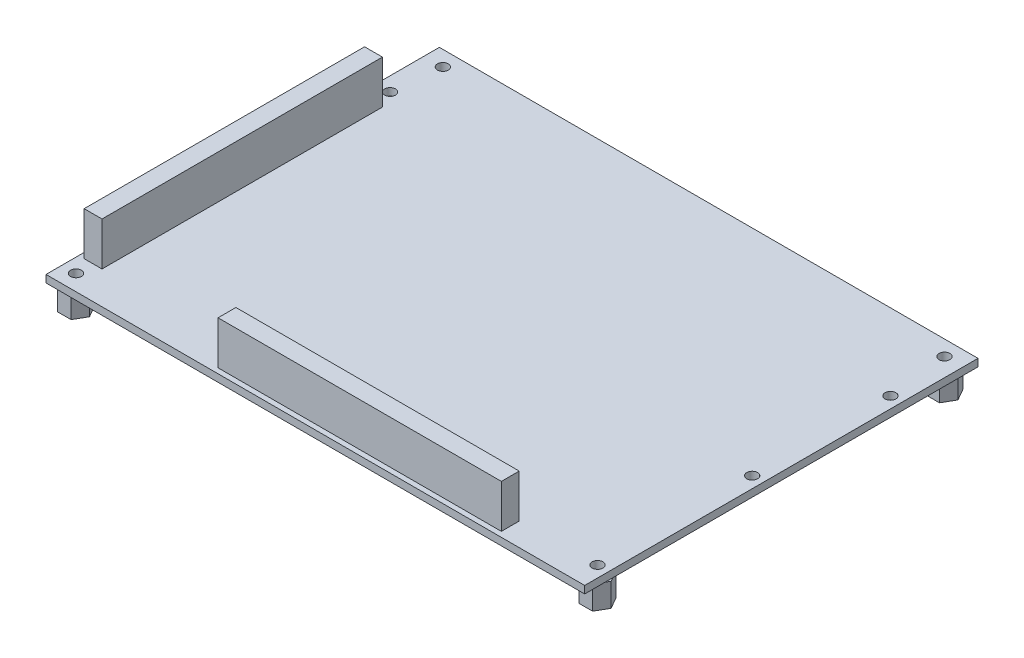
ISO-10303-21;
HEADER;
FILE_DESCRIPTION(('STEP AP214'),'2;1');
FILE_NAME('part.step','',(''),(''),'','','');
FILE_SCHEMA(('AUTOMOTIVE_DESIGN { 1 0 10303 214 1 1 1 1 }'));
ENDSEC;
DATA;
#1=APPLICATION_CONTEXT('core data for automotive mechanical design processes');
#2=APPLICATION_PROTOCOL_DEFINITION('international standard','automotive_design',2000,#1);
#3=PRODUCT_CONTEXT('',#1,'mechanical');
#4=PRODUCT('Part','Part','',(#3));
#5=PRODUCT_RELATED_PRODUCT_CATEGORY('part','',(#4));
#6=PRODUCT_DEFINITION_FORMATION('','',#4);
#7=PRODUCT_DEFINITION_CONTEXT('part definition',#1,'design');
#8=PRODUCT_DEFINITION('design','',#6,#7);
#9=PRODUCT_DEFINITION_SHAPE('','',#8);
#10=(LENGTH_UNIT() NAMED_UNIT(*) SI_UNIT(.MILLI.,.METRE.));
#11=(NAMED_UNIT(*) PLANE_ANGLE_UNIT() SI_UNIT($,.RADIAN.));
#12=(NAMED_UNIT(*) SI_UNIT($,.STERADIAN.) SOLID_ANGLE_UNIT());
#13=UNCERTAINTY_MEASURE_WITH_UNIT(LENGTH_MEASURE(1.E-05),#10,'distance_accuracy_value','');
#14=(GEOMETRIC_REPRESENTATION_CONTEXT(3) GLOBAL_UNCERTAINTY_ASSIGNED_CONTEXT((#13)) GLOBAL_UNIT_ASSIGNED_CONTEXT((#10,
#11,#12)) REPRESENTATION_CONTEXT('',''));
#15=CARTESIAN_POINT('',(0.,0.,0.));
#16=DIRECTION('',(0.,0.,1.));
#17=DIRECTION('',(1.,0.,0.));
#18=AXIS2_PLACEMENT_3D('',#15,#16,#17);
#19=CARTESIAN_POINT('',(0.,0.,-106.5657));
#20=DIRECTION('',(0.,-1.,0.));
#21=DIRECTION('',(0.,0.,-1.));
#22=AXIS2_PLACEMENT_3D('',#19,#20,#21);
#23=PLANE('',#22);
#24=DIRECTION('',(-0.499999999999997,0.,0.86602540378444));
#25=VECTOR('',#24,1.);
#26=CARTESIAN_POINT('',(144.636174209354,0.,-102.4382));
#27=LINE('',#26,#25);
#28=CARTESIAN_POINT('',(144.636174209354,0.,-102.4382));
#29=VERTEX_POINT('',#28);
#30=CARTESIAN_POINT('',(142.803087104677,0.,-99.2632));
#31=VERTEX_POINT('',#30);
#32=EDGE_CURVE('E339',#29,#31,#27,.T.);
#33=ORIENTED_EDGE('',*,*,#32,.F.);
#34=DIRECTION('',(0.499999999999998,0.,0.866025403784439));
#35=VECTOR('',#34,1.);
#36=CARTESIAN_POINT('',(142.803087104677,0.,-105.6132));
#37=LINE('',#36,#35);
#38=CARTESIAN_POINT('',(142.803087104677,0.,-105.6132));
#39=VERTEX_POINT('',#38);
#40=EDGE_CURVE('E336',#39,#29,#37,.T.);
#41=ORIENTED_EDGE('',*,*,#40,.F.);
#42=DIRECTION('',(1.,0.,0.));
#43=VECTOR('',#42,1.);
#44=CARTESIAN_POINT('',(139.136912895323,0.,-105.6132));
#45=LINE('',#44,#43);
#46=CARTESIAN_POINT('',(139.136912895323,0.,-105.6132));
#47=VERTEX_POINT('',#46);
#48=EDGE_CURVE('E347',#47,#39,#45,.T.);
#49=ORIENTED_EDGE('',*,*,#48,.F.);
#50=DIRECTION('',(0.500000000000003,0.,-0.866025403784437));
#51=VECTOR('',#50,1.);
#52=CARTESIAN_POINT('',(137.303825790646,0.,-102.4382));
#53=LINE('',#52,#51);
#54=CARTESIAN_POINT('',(137.303825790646,0.,-102.4382));
#55=VERTEX_POINT('',#54);
#56=EDGE_CURVE('E345',#55,#47,#53,.T.);
#57=ORIENTED_EDGE('',*,*,#56,.F.);
#58=DIRECTION('',(-0.499999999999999,0.,-0.866025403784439));
#59=VECTOR('',#58,1.);
#60=CARTESIAN_POINT('',(139.136912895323,0.,-99.2632));
#61=LINE('',#60,#59);
#62=CARTESIAN_POINT('',(139.136912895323,0.,-99.2632));
#63=VERTEX_POINT('',#62);
#64=EDGE_CURVE('E343',#63,#55,#61,.T.);
#65=ORIENTED_EDGE('',*,*,#64,.F.);
#66=DIRECTION('',(-1.,0.,0.));
#67=VECTOR('',#66,1.);
#68=CARTESIAN_POINT('',(142.803087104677,0.,-99.2632));
#69=LINE('',#68,#67);
#70=EDGE_CURVE('E341',#31,#63,#69,.T.);
#71=ORIENTED_EDGE('',*,*,#70,.F.);
#72=EDGE_LOOP('',(#33,#41,#49,#57,#65,#71));
#73=FACE_BOUND('',#72,.T.);
#74=DIRECTION('',(0.5,0.,0.866025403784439));
#75=VECTOR('',#74,1.);
#76=CARTESIAN_POINT('',(5.64308710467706,0.,-7.493));
#77=LINE('',#76,#75);
#78=CARTESIAN_POINT('',(5.64308710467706,0.,-7.493));
#79=VERTEX_POINT('',#78);
#80=CARTESIAN_POINT('',(7.47617420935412,0.,-4.318));
#81=VERTEX_POINT('',#80);
#82=EDGE_CURVE('E434',#79,#81,#77,.T.);
#83=ORIENTED_EDGE('',*,*,#82,.F.);
#84=DIRECTION('',(1.,0.,0.));
#85=VECTOR('',#84,1.);
#86=CARTESIAN_POINT('',(1.97691289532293,0.,-7.493));
#87=LINE('',#86,#85);
#88=CARTESIAN_POINT('',(1.97691289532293,0.,-7.493));
#89=VERTEX_POINT('',#88);
#90=EDGE_CURVE('E431',#89,#79,#87,.T.);
#91=ORIENTED_EDGE('',*,*,#90,.F.);
#92=DIRECTION('',(0.5,0.,-0.866025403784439));
#93=VECTOR('',#92,1.);
#94=CARTESIAN_POINT('',(0.143825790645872,0.,-4.318));
#95=LINE('',#94,#93);
#96=CARTESIAN_POINT('',(0.143825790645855,0.,-4.31799999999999));
#97=VERTEX_POINT('',#96);
#98=EDGE_CURVE('E443',#97,#89,#95,.T.);
#99=ORIENTED_EDGE('',*,*,#98,.F.);
#100=DIRECTION('',(-0.500000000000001,0.,-0.866025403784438));
#101=VECTOR('',#100,1.);
#102=CARTESIAN_POINT('',(1.97691289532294,0.,-1.143));
#103=LINE('',#102,#101);
#104=CARTESIAN_POINT('',(1.97691289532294,0.,-1.143));
#105=VERTEX_POINT('',#104);
#106=EDGE_CURVE('E440',#105,#97,#103,.T.);
#107=ORIENTED_EDGE('',*,*,#106,.F.);
#108=DIRECTION('',(-1.,0.,0.));
#109=VECTOR('',#108,1.);
#110=CARTESIAN_POINT('',(5.64308710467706,0.,-1.143));
#111=LINE('',#110,#109);
#112=CARTESIAN_POINT('',(5.64308710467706,0.,-1.143));
#113=VERTEX_POINT('',#112);
#114=EDGE_CURVE('E438',#113,#105,#111,.T.);
#115=ORIENTED_EDGE('',*,*,#114,.F.);
#116=DIRECTION('',(-0.5,0.,0.866025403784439));
#117=VECTOR('',#116,1.);
#118=CARTESIAN_POINT('',(7.47617420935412,0.,-4.318));
#119=LINE('',#118,#117);
#120=EDGE_CURVE('E436',#81,#113,#119,.T.);
#121=ORIENTED_EDGE('',*,*,#120,.F.);
#122=EDGE_LOOP('',(#83,#91,#99,#107,#115,#121));
#123=FACE_BOUND('',#122,.T.);
#124=CARTESIAN_POINT('',(142.875,0.,-48.4505));
#125=DIRECTION('',(0.,1.,0.));
#126=DIRECTION('',(0.,0.,1.));
#127=AXIS2_PLACEMENT_3D('',#124,#125,#126);
#128=CIRCLE('',#127,1.4732);
#129=CARTESIAN_POINT('',(142.875,0.,-46.9773));
#130=VERTEX_POINT('',#129);
#131=EDGE_CURVE('E549',#130,#130,#128,.T.);
#132=ORIENTED_EDGE('',*,*,#131,.T.);
#133=EDGE_LOOP('',(#132));
#134=FACE_BOUND('',#133,.T.);
#135=CARTESIAN_POINT('',(3.81,0.,-89.408));
#136=DIRECTION('',(0.,1.,0.));
#137=DIRECTION('',(0.,0.,1.));
#138=AXIS2_PLACEMENT_3D('',#135,#136,#137);
#139=CIRCLE('',#138,1.4732);
#140=CARTESIAN_POINT('',(3.81,0.,-87.9348));
#141=VERTEX_POINT('',#140);
#142=EDGE_CURVE('E564',#141,#141,#139,.T.);
#143=ORIENTED_EDGE('',*,*,#142,.T.);
#144=EDGE_LOOP('',(#143));
#145=FACE_BOUND('',#144,.T.);
#146=CARTESIAN_POINT('',(142.875,0.,-85.9155));
#147=DIRECTION('',(0.,1.,0.));
#148=DIRECTION('',(0.,0.,1.));
#149=AXIS2_PLACEMENT_3D('',#146,#147,#148);
#150=CIRCLE('',#149,1.4732);
#151=CARTESIAN_POINT('',(142.875,0.,-84.4423));
#152=VERTEX_POINT('',#151);
#153=EDGE_CURVE('E555',#152,#152,#150,.T.);
#154=ORIENTED_EDGE('',*,*,#153,.T.);
#155=EDGE_LOOP('',(#154));
#156=FACE_BOUND('',#155,.T.);
#157=DIRECTION('',(0.,0.,-1.));
#158=VECTOR('',#157,1.);
#159=CARTESIAN_POINT('',(145.9357,0.,-106.5657));
#160=LINE('',#159,#158);
#161=CARTESIAN_POINT('',(145.9357,0.,-7.60191209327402));
#162=VERTEX_POINT('',#161);
#163=CARTESIAN_POINT('',(145.9357,0.,-106.5657));
#164=VERTEX_POINT('',#163);
#165=EDGE_CURVE('E573',#162,#164,#160,.T.);
#166=ORIENTED_EDGE('',*,*,#165,.F.);
#167=DIRECTION('',(0.500000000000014,0.,0.866025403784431));
#168=VECTOR('',#167,1.);
#169=CARTESIAN_POINT('',(144.708087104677,0.,-9.7282));
#170=LINE('',#169,#168);
#171=CARTESIAN_POINT('',(144.708087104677,0.,-9.7282));
#172=VERTEX_POINT('',#171);
#173=EDGE_CURVE('E386',#172,#162,#170,.T.);
#174=ORIENTED_EDGE('',*,*,#173,.F.);
#175=DIRECTION('',(1.,0.,0.));
#176=VECTOR('',#175,1.);
#177=CARTESIAN_POINT('',(141.041912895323,0.,-9.7282));
#178=LINE('',#177,#176);
#179=CARTESIAN_POINT('',(141.041912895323,0.,-9.7282));
#180=VERTEX_POINT('',#179);
#181=EDGE_CURVE('E383',#180,#172,#178,.T.);
#182=ORIENTED_EDGE('',*,*,#181,.F.);
#183=DIRECTION('',(0.500000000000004,0.,-0.866025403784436));
#184=VECTOR('',#183,1.);
#185=CARTESIAN_POINT('',(139.208825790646,0.,-6.55319999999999));
#186=LINE('',#185,#184);
#187=CARTESIAN_POINT('',(139.208825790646,0.,-6.55319999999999));
#188=VERTEX_POINT('',#187);
#189=EDGE_CURVE('E380',#188,#180,#186,.T.);
#190=ORIENTED_EDGE('',*,*,#189,.F.);
#191=DIRECTION('',(-0.500000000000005,0.,-0.866025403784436));
#192=VECTOR('',#191,1.);
#193=CARTESIAN_POINT('',(141.041912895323,0.,-3.3782));
#194=LINE('',#193,#192);
#195=CARTESIAN_POINT('',(141.041912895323,0.,-3.3782));
#196=VERTEX_POINT('',#195);
#197=EDGE_CURVE('E394',#196,#188,#194,.T.);
#198=ORIENTED_EDGE('',*,*,#197,.F.);
#199=DIRECTION('',(-1.,0.,0.));
#200=VECTOR('',#199,1.);
#201=CARTESIAN_POINT('',(144.708087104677,0.,-3.3782));
#202=LINE('',#201,#200);
#203=CARTESIAN_POINT('',(144.708087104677,0.,-3.3782));
#204=VERTEX_POINT('',#203);
#205=EDGE_CURVE('E392',#204,#196,#202,.T.);
#206=ORIENTED_EDGE('',*,*,#205,.F.);
#207=DIRECTION('',(-0.500000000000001,0.,0.866025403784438));
#208=VECTOR('',#207,1.);
#209=CARTESIAN_POINT('',(146.541174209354,0.,-6.55320000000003));
#210=LINE('',#209,#208);
#211=CARTESIAN_POINT('',(145.9357,0.,-5.50448790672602));
#212=VERTEX_POINT('',#211);
#213=EDGE_CURVE('E388',#212,#204,#210,.T.);
#214=ORIENTED_EDGE('',*,*,#213,.F.);
#215=CARTESIAN_POINT('',(145.9357,0.,0.));
#216=VERTEX_POINT('',#215);
#217=EDGE_CURVE('E574',#216,#212,#160,.T.);
#218=ORIENTED_EDGE('',*,*,#217,.F.);
#219=DIRECTION('',(1.,0.,0.));
#220=VECTOR('',#219,1.);
#221=CARTESIAN_POINT('',(0.,0.,0.));
#222=LINE('',#221,#220);
#223=CARTESIAN_POINT('',(0.,0.,0.));
#224=VERTEX_POINT('',#223);
#225=EDGE_CURVE('E570',#224,#216,#222,.T.);
#226=ORIENTED_EDGE('',*,*,#225,.F.);
#227=DIRECTION('',(0.,0.,1.));
#228=VECTOR('',#227,1.);
#229=CARTESIAN_POINT('',(0.,0.,-92.5957));
#230=LINE('',#229,#228);
#231=CARTESIAN_POINT('',(0.,0.,-106.5657));
#232=VERTEX_POINT('',#231);
#233=EDGE_CURVE('E579',#232,#224,#230,.T.);
#234=ORIENTED_EDGE('',*,*,#233,.F.);
#235=DIRECTION('',(-1.,0.,0.));
#236=VECTOR('',#235,1.);
#237=CARTESIAN_POINT('',(0.,0.,-106.5657));
#238=LINE('',#237,#236);
#239=EDGE_CURVE('E577',#164,#232,#238,.T.);
#240=ORIENTED_EDGE('',*,*,#239,.F.);
#241=EDGE_LOOP('',(#166,#174,#182,#190,#198,#206,#214,#218,#226,#234,#240));
#242=FACE_BOUND('',#241,.T.);
#243=DIRECTION('',(-0.500000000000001,0.,0.866025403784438));
#244=VECTOR('',#243,1.);
#245=CARTESIAN_POINT('',(8.74617420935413,0.,-102.4382));
#246=LINE('',#245,#244);
#247=CARTESIAN_POINT('',(8.74617420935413,0.,-102.4382));
#248=VERTEX_POINT('',#247);
#249=CARTESIAN_POINT('',(6.91308710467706,0.,-99.2632));
#250=VERTEX_POINT('',#249);
#251=EDGE_CURVE('E282',#248,#250,#246,.T.);
#252=ORIENTED_EDGE('',*,*,#251,.F.);
#253=DIRECTION('',(0.5,0.,0.866025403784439));
#254=VECTOR('',#253,1.);
#255=CARTESIAN_POINT('',(6.91308710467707,0.,-105.6132));
#256=LINE('',#255,#254);
#257=CARTESIAN_POINT('',(6.91308710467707,0.,-105.6132));
#258=VERTEX_POINT('',#257);
#259=EDGE_CURVE('E293',#258,#248,#256,.T.);
#260=ORIENTED_EDGE('',*,*,#259,.F.);
#261=DIRECTION('',(1.,0.,0.));
#262=VECTOR('',#261,1.);
#263=CARTESIAN_POINT('',(3.24691289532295,0.,-105.6132));
#264=LINE('',#263,#262);
#265=CARTESIAN_POINT('',(3.24691289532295,0.,-105.6132));
#266=VERTEX_POINT('',#265);
#267=EDGE_CURVE('E312',#266,#258,#264,.T.);
#268=ORIENTED_EDGE('',*,*,#267,.F.);
#269=DIRECTION('',(0.5,0.,-0.866025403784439));
#270=VECTOR('',#269,1.);
#271=CARTESIAN_POINT('',(1.41382579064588,0.,-102.4382));
#272=LINE('',#271,#270);
#273=CARTESIAN_POINT('',(1.41382579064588,0.,-102.4382));
#274=VERTEX_POINT('',#273);
#275=EDGE_CURVE('E310',#274,#266,#272,.T.);
#276=ORIENTED_EDGE('',*,*,#275,.F.);
#277=DIRECTION('',(-0.5,0.,-0.866025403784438));
#278=VECTOR('',#277,1.);
#279=CARTESIAN_POINT('',(3.24691289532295,0.,-99.2632));
#280=LINE('',#279,#278);
#281=CARTESIAN_POINT('',(3.24691289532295,0.,-99.2632));
#282=VERTEX_POINT('',#281);
#283=EDGE_CURVE('E305',#282,#274,#280,.T.);
#284=ORIENTED_EDGE('',*,*,#283,.F.);
#285=DIRECTION('',(-1.,0.,0.));
#286=VECTOR('',#285,1.);
#287=CARTESIAN_POINT('',(6.91308710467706,0.,-99.2632));
#288=LINE('',#287,#286);
#289=EDGE_CURVE('E303',#250,#282,#288,.T.);
#290=ORIENTED_EDGE('',*,*,#289,.F.);
#291=EDGE_LOOP('',(#252,#260,#268,#276,#284,#290));
#292=FACE_BOUND('',#291,.T.);
#293=ADVANCED_FACE('F37',(#73,#123,#134,#145,#156,#242,#292),#23,.T.);
#294=CARTESIAN_POINT('',(0.,2.0066,-106.5657));
#295=DIRECTION('',(0.,-1.,0.));
#296=DIRECTION('',(0.,0.,-1.));
#297=AXIS2_PLACEMENT_3D('',#294,#295,#296);
#298=PLANE('',#297);
#299=DIRECTION('',(-1.,0.,0.));
#300=VECTOR('',#299,1.);
#301=CARTESIAN_POINT('',(1.4732,2.0066,-8.8646));
#302=LINE('',#301,#300);
#303=CARTESIAN_POINT('',(6.3119,2.0066,-8.8646));
#304=VERTEX_POINT('',#303);
#305=CARTESIAN_POINT('',(1.4732,2.0066,-8.8646));
#306=VERTEX_POINT('',#305);
#307=EDGE_CURVE('E483',#304,#306,#302,.T.);
#308=ORIENTED_EDGE('',*,*,#307,.T.);
#309=DIRECTION('',(0.,0.,-1.));
#310=VECTOR('',#309,1.);
#311=CARTESIAN_POINT('',(1.4732,2.0066,-8.8646));
#312=LINE('',#311,#310);
#313=CARTESIAN_POINT('',(1.47320000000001,2.0066,-84.836));
#314=VERTEX_POINT('',#313);
#315=EDGE_CURVE('E474',#306,#314,#312,.T.);
#316=ORIENTED_EDGE('',*,*,#315,.T.);
#317=DIRECTION('',(1.,0.,0.));
#318=VECTOR('',#317,1.);
#319=CARTESIAN_POINT('',(1.47320000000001,2.0066,-84.836));
#320=LINE('',#319,#318);
#321=CARTESIAN_POINT('',(6.31190000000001,2.0066,-84.836));
#322=VERTEX_POINT('',#321);
#323=EDGE_CURVE('E477',#314,#322,#320,.T.);
#324=ORIENTED_EDGE('',*,*,#323,.T.);
#325=DIRECTION('',(0.,0.,1.));
#326=VECTOR('',#325,1.);
#327=CARTESIAN_POINT('',(6.3119,2.0066,-8.8646));
#328=LINE('',#327,#326);
#329=EDGE_CURVE('E480',#322,#304,#328,.T.);
#330=ORIENTED_EDGE('',*,*,#329,.T.);
#331=EDGE_LOOP('',(#308,#316,#324,#330));
#332=FACE_BOUND('',#331,.T.);
#333=DIRECTION('',(-1.,0.,0.));
#334=VECTOR('',#333,1.);
#335=CARTESIAN_POINT('',(45.212,2.0066,-1.397));
#336=LINE('',#335,#334);
#337=CARTESIAN_POINT('',(121.9708,2.0066,-1.397));
#338=VERTEX_POINT('',#337);
#339=CARTESIAN_POINT('',(45.212,2.0066,-1.397));
#340=VERTEX_POINT('',#339);
#341=EDGE_CURVE('E516',#338,#340,#336,.T.);
#342=ORIENTED_EDGE('',*,*,#341,.T.);
#343=DIRECTION('',(0.,0.,-1.));
#344=VECTOR('',#343,1.);
#345=CARTESIAN_POINT('',(45.212,2.0066,-1.397));
#346=LINE('',#345,#344);
#347=CARTESIAN_POINT('',(45.212,2.0066,-6.2357));
#348=VERTEX_POINT('',#347);
#349=EDGE_CURVE('E501',#340,#348,#346,.T.);
#350=ORIENTED_EDGE('',*,*,#349,.T.);
#351=DIRECTION('',(1.,0.,0.));
#352=VECTOR('',#351,1.);
#353=CARTESIAN_POINT('',(45.212,2.0066,-6.2357));
#354=LINE('',#353,#352);
#355=CARTESIAN_POINT('',(121.9708,2.0066,-6.2357));
#356=VERTEX_POINT('',#355);
#357=EDGE_CURVE('E510',#348,#356,#354,.T.);
#358=ORIENTED_EDGE('',*,*,#357,.T.);
#359=DIRECTION('',(0.,0.,1.));
#360=VECTOR('',#359,1.);
#361=CARTESIAN_POINT('',(121.9708,2.0066,-1.397));
#362=LINE('',#361,#360);
#363=EDGE_CURVE('E513',#356,#338,#362,.T.);
#364=ORIENTED_EDGE('',*,*,#363,.T.);
#365=EDGE_LOOP('',(#342,#350,#358,#364));
#366=FACE_BOUND('',#365,.T.);
#367=CARTESIAN_POINT('',(140.97,2.0066,-102.4382));
#368=DIRECTION('',(0.,1.,0.));
#369=DIRECTION('',(0.,0.,1.));
#370=AXIS2_PLACEMENT_3D('',#367,#368,#369);
#371=CIRCLE('',#370,1.4732);
#372=CARTESIAN_POINT('',(140.97,2.0066,-100.965));
#373=VERTEX_POINT('',#372);
#374=EDGE_CURVE('E543',#373,#373,#371,.T.);
#375=ORIENTED_EDGE('',*,*,#374,.F.);
#376=EDGE_LOOP('',(#375));
#377=FACE_BOUND('',#376,.T.);
#378=CARTESIAN_POINT('',(142.875,2.0066,-48.4505));
#379=DIRECTION('',(0.,1.,0.));
#380=DIRECTION('',(0.,0.,1.));
#381=AXIS2_PLACEMENT_3D('',#378,#379,#380);
#382=CIRCLE('',#381,1.4732);
#383=CARTESIAN_POINT('',(142.875,2.0066,-46.9773));
#384=VERTEX_POINT('',#383);
#385=EDGE_CURVE('E552',#384,#384,#382,.T.);
#386=ORIENTED_EDGE('',*,*,#385,.F.);
#387=EDGE_LOOP('',(#386));
#388=FACE_BOUND('',#387,.T.);
#389=CARTESIAN_POINT('',(3.81,2.0066,-4.318));
#390=DIRECTION('',(0.,1.,0.));
#391=DIRECTION('',(0.,0.,1.));
#392=AXIS2_PLACEMENT_3D('',#389,#390,#391);
#393=CIRCLE('',#392,1.4732);
#394=CARTESIAN_POINT('',(3.81,2.0066,-2.8448));
#395=VERTEX_POINT('',#394);
#396=EDGE_CURVE('E561',#395,#395,#393,.T.);
#397=ORIENTED_EDGE('',*,*,#396,.F.);
#398=EDGE_LOOP('',(#397));
#399=FACE_BOUND('',#398,.T.);
#400=DIRECTION('',(0.,0.,1.));
#401=VECTOR('',#400,1.);
#402=CARTESIAN_POINT('',(0.,2.0066,0.));
#403=LINE('',#402,#401);
#404=CARTESIAN_POINT('',(0.,2.0066,-106.5657));
#405=VERTEX_POINT('',#404);
#406=CARTESIAN_POINT('',(0.,2.0066,0.));
#407=VERTEX_POINT('',#406);
#408=EDGE_CURVE('E581',#405,#407,#403,.T.);
#409=ORIENTED_EDGE('',*,*,#408,.T.);
#410=DIRECTION('',(1.,0.,0.));
#411=VECTOR('',#410,1.);
#412=CARTESIAN_POINT('',(0.,2.0066,0.));
#413=LINE('',#412,#411);
#414=CARTESIAN_POINT('',(145.9357,2.0066,0.));
#415=VERTEX_POINT('',#414);
#416=EDGE_CURVE('E584',#407,#415,#413,.T.);
#417=ORIENTED_EDGE('',*,*,#416,.T.);
#418=DIRECTION('',(0.,0.,-1.));
#419=VECTOR('',#418,1.);
#420=CARTESIAN_POINT('',(145.9357,2.0066,0.));
#421=LINE('',#420,#419);
#422=CARTESIAN_POINT('',(145.9357,2.0066,-106.5657));
#423=VERTEX_POINT('',#422);
#424=EDGE_CURVE('E586',#415,#423,#421,.T.);
#425=ORIENTED_EDGE('',*,*,#424,.T.);
#426=DIRECTION('',(-1.,0.,0.));
#427=VECTOR('',#426,1.);
#428=CARTESIAN_POINT('',(0.,2.0066,-106.5657));
#429=LINE('',#428,#427);
#430=EDGE_CURVE('E588',#423,#405,#429,.T.);
#431=ORIENTED_EDGE('',*,*,#430,.T.);
#432=EDGE_LOOP('',(#409,#417,#425,#431));
#433=FACE_BOUND('',#432,.T.);
#434=CARTESIAN_POINT('',(3.81,2.0066,-89.408));
#435=DIRECTION('',(0.,1.,0.));
#436=DIRECTION('',(0.,0.,1.));
#437=AXIS2_PLACEMENT_3D('',#434,#435,#436);
#438=CIRCLE('',#437,1.4732);
#439=CARTESIAN_POINT('',(3.81,2.0066,-87.9348));
#440=VERTEX_POINT('',#439);
#441=EDGE_CURVE('E567',#440,#440,#438,.T.);
#442=ORIENTED_EDGE('',*,*,#441,.F.);
#443=EDGE_LOOP('',(#442));
#444=FACE_BOUND('',#443,.T.);
#445=CARTESIAN_POINT('',(142.875,2.0066,-85.9155));
#446=DIRECTION('',(0.,1.,0.));
#447=DIRECTION('',(0.,0.,1.));
#448=AXIS2_PLACEMENT_3D('',#445,#446,#447);
#449=CIRCLE('',#448,1.4732);
#450=CARTESIAN_POINT('',(142.875,2.0066,-84.4423));
#451=VERTEX_POINT('',#450);
#452=EDGE_CURVE('E558',#451,#451,#449,.T.);
#453=ORIENTED_EDGE('',*,*,#452,.F.);
#454=EDGE_LOOP('',(#453));
#455=FACE_BOUND('',#454,.T.);
#456=CARTESIAN_POINT('',(5.08,2.0066,-102.4382));
#457=DIRECTION('',(0.,1.,0.));
#458=DIRECTION('',(0.,0.,1.));
#459=AXIS2_PLACEMENT_3D('',#456,#457,#458);
#460=CIRCLE('',#459,1.4732);
#461=CARTESIAN_POINT('',(5.08,2.0066,-100.965));
#462=VERTEX_POINT('',#461);
#463=EDGE_CURVE('E546',#462,#462,#460,.T.);
#464=ORIENTED_EDGE('',*,*,#463,.F.);
#465=EDGE_LOOP('',(#464));
#466=FACE_BOUND('',#465,.T.);
#467=CARTESIAN_POINT('',(142.875,2.0066,-6.5532));
#468=DIRECTION('',(0.,1.,0.));
#469=DIRECTION('',(0.,0.,1.));
#470=AXIS2_PLACEMENT_3D('',#467,#468,#469);
#471=CIRCLE('',#470,1.4732);
#472=CARTESIAN_POINT('',(142.875,2.0066,-5.07999999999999));
#473=VERTEX_POINT('',#472);
#474=EDGE_CURVE('E534',#473,#473,#471,.T.);
#475=ORIENTED_EDGE('',*,*,#474,.F.);
#476=EDGE_LOOP('',(#475));
#477=FACE_BOUND('',#476,.T.);
#478=ADVANCED_FACE('F639',(#332,#366,#377,#388,#399,#433,#444,#455,#466,#477),#298,.F.);
#479=CARTESIAN_POINT('',(0.,2.0066,0.));
#480=DIRECTION('',(0.,0.,-1.));
#481=DIRECTION('',(-1.,0.,0.));
#482=AXIS2_PLACEMENT_3D('',#479,#480,#481);
#483=PLANE('',#482);
#484=ORIENTED_EDGE('',*,*,#225,.T.);
#485=DIRECTION('',(0.,-1.,0.));
#486=VECTOR('',#485,1.);
#487=CARTESIAN_POINT('',(145.9357,2.0066,0.));
#488=LINE('',#487,#486);
#489=EDGE_CURVE('E45',#415,#216,#488,.T.);
#490=ORIENTED_EDGE('',*,*,#489,.F.);
#491=ORIENTED_EDGE('',*,*,#416,.F.);
#492=DIRECTION('',(0.,-1.,0.));
#493=VECTOR('',#492,1.);
#494=CARTESIAN_POINT('',(0.,2.0066,0.));
#495=LINE('',#494,#493);
#496=EDGE_CURVE('E11',#407,#224,#495,.T.);
#497=ORIENTED_EDGE('',*,*,#496,.T.);
#498=EDGE_LOOP('',(#484,#490,#491,#497));
#499=FACE_BOUND('',#498,.T.);
#500=ADVANCED_FACE('F39',(#499),#483,.F.);
#501=CARTESIAN_POINT('',(145.9357,2.0066,-106.5657));
#502=DIRECTION('',(-1.,0.,0.));
#503=DIRECTION('',(0.,0.,1.));
#504=AXIS2_PLACEMENT_3D('',#501,#502,#503);
#505=PLANE('',#504);
#506=ORIENTED_EDGE('',*,*,#217,.T.);
#507=DIRECTION('',(0.,0.,1.));
#508=VECTOR('',#507,1.);
#509=CARTESIAN_POINT('',(145.9357,0.,-106.5657));
#510=LINE('',#509,#508);
#511=EDGE_CURVE('E426',#162,#212,#510,.T.);
#512=ORIENTED_EDGE('',*,*,#511,.F.);
#513=ORIENTED_EDGE('',*,*,#165,.T.);
#514=DIRECTION('',(0.,-1.,0.));
#515=VECTOR('',#514,1.);
#516=CARTESIAN_POINT('',(145.9357,2.0066,-106.5657));
#517=LINE('',#516,#515);
#518=EDGE_CURVE('E594',#423,#164,#517,.T.);
#519=ORIENTED_EDGE('',*,*,#518,.F.);
#520=ORIENTED_EDGE('',*,*,#424,.F.);
#521=ORIENTED_EDGE('',*,*,#489,.T.);
#522=EDGE_LOOP('',(#506,#512,#513,#519,#520,#521));
#523=FACE_BOUND('',#522,.T.);
#524=ADVANCED_FACE('F600',(#523),#505,.F.);
#525=CARTESIAN_POINT('',(0.,2.0066,-106.5657));
#526=DIRECTION('',(0.,0.,1.));
#527=DIRECTION('',(1.,0.,0.));
#528=AXIS2_PLACEMENT_3D('',#525,#526,#527);
#529=PLANE('',#528);
#530=ORIENTED_EDGE('',*,*,#239,.T.);
#531=DIRECTION('',(0.,-1.,0.));
#532=VECTOR('',#531,1.);
#533=CARTESIAN_POINT('',(0.,2.0066,-106.5657));
#534=LINE('',#533,#532);
#535=EDGE_CURVE('E591',#405,#232,#534,.T.);
#536=ORIENTED_EDGE('',*,*,#535,.F.);
#537=ORIENTED_EDGE('',*,*,#430,.F.);
#538=ORIENTED_EDGE('',*,*,#518,.T.);
#539=EDGE_LOOP('',(#530,#536,#537,#538));
#540=FACE_BOUND('',#539,.T.);
#541=ADVANCED_FACE('F636',(#540),#529,.F.);
#542=CARTESIAN_POINT('',(0.,2.0066,-92.5957));
#543=DIRECTION('',(1.,0.,0.));
#544=DIRECTION('',(0.,0.,-1.));
#545=AXIS2_PLACEMENT_3D('',#542,#543,#544);
#546=PLANE('',#545);
#547=ORIENTED_EDGE('',*,*,#233,.T.);
#548=ORIENTED_EDGE('',*,*,#496,.F.);
#549=ORIENTED_EDGE('',*,*,#408,.F.);
#550=ORIENTED_EDGE('',*,*,#535,.T.);
#551=EDGE_LOOP('',(#547,#548,#549,#550));
#552=FACE_BOUND('',#551,.T.);
#553=ADVANCED_FACE('F642',(#552),#546,.F.);
#554=CARTESIAN_POINT('',(3.81,2.0066,-89.408));
#555=DIRECTION('',(0.,-1.,0.));
#556=DIRECTION('',(0.,0.,-1.));
#557=AXIS2_PLACEMENT_3D('',#554,#555,#556);
#558=CYLINDRICAL_SURFACE('',#557,1.4732);
#559=ORIENTED_EDGE('',*,*,#441,.T.);
#560=EDGE_LOOP('',(#559));
#561=FACE_BOUND('',#560,.T.);
#562=ORIENTED_EDGE('',*,*,#142,.F.);
#563=EDGE_LOOP('',(#562));
#564=FACE_BOUND('',#563,.T.);
#565=ADVANCED_FACE('F644',(#561,#564),#558,.F.);
#566=CARTESIAN_POINT('',(3.81,2.0066,-4.318));
#567=DIRECTION('',(0.,-1.,0.));
#568=DIRECTION('',(0.,0.,-1.));
#569=AXIS2_PLACEMENT_3D('',#566,#567,#568);
#570=CYLINDRICAL_SURFACE('',#569,1.4732);
#571=ORIENTED_EDGE('',*,*,#396,.T.);
#572=EDGE_LOOP('',(#571));
#573=FACE_BOUND('',#572,.T.);
#574=CARTESIAN_POINT('',(3.81,-6.35,-4.318));
#575=DIRECTION('',(0.,-1.,0.));
#576=DIRECTION('',(0.,0.,-1.));
#577=AXIS2_PLACEMENT_3D('',#574,#575,#576);
#578=CIRCLE('',#577,1.4732);
#579=CARTESIAN_POINT('',(3.81,-6.35,-5.7912));
#580=VERTEX_POINT('',#579);
#581=EDGE_CURVE('E428',#580,#580,#578,.T.);
#582=ORIENTED_EDGE('',*,*,#581,.T.);
#583=EDGE_LOOP('',(#582));
#584=FACE_BOUND('',#583,.T.);
#585=ADVANCED_FACE('F650',(#573,#584),#570,.F.);
#586=CARTESIAN_POINT('',(142.875,2.0066,-85.9155));
#587=DIRECTION('',(0.,-1.,0.));
#588=DIRECTION('',(0.,0.,-1.));
#589=AXIS2_PLACEMENT_3D('',#586,#587,#588);
#590=CYLINDRICAL_SURFACE('',#589,1.4732);
#591=ORIENTED_EDGE('',*,*,#452,.T.);
#592=EDGE_LOOP('',(#591));
#593=FACE_BOUND('',#592,.T.);
#594=ORIENTED_EDGE('',*,*,#153,.F.);
#595=EDGE_LOOP('',(#594));
#596=FACE_BOUND('',#595,.T.);
#597=ADVANCED_FACE('F667',(#593,#596),#590,.F.);
#598=CARTESIAN_POINT('',(142.875,2.0066,-48.4505));
#599=DIRECTION('',(0.,-1.,0.));
#600=DIRECTION('',(0.,0.,-1.));
#601=AXIS2_PLACEMENT_3D('',#598,#599,#600);
#602=CYLINDRICAL_SURFACE('',#601,1.4732);
#603=ORIENTED_EDGE('',*,*,#385,.T.);
#604=EDGE_LOOP('',(#603));
#605=FACE_BOUND('',#604,.T.);
#606=ORIENTED_EDGE('',*,*,#131,.F.);
#607=EDGE_LOOP('',(#606));
#608=FACE_BOUND('',#607,.T.);
#609=ADVANCED_FACE('F671',(#605,#608),#602,.F.);
#610=CARTESIAN_POINT('',(5.08,2.0066,-102.4382));
#611=DIRECTION('',(0.,-1.,0.));
#612=DIRECTION('',(0.,0.,-1.));
#613=AXIS2_PLACEMENT_3D('',#610,#611,#612);
#614=CYLINDRICAL_SURFACE('',#613,1.4732);
#615=ORIENTED_EDGE('',*,*,#463,.T.);
#616=EDGE_LOOP('',(#615));
#617=FACE_BOUND('',#616,.T.);
#618=CARTESIAN_POINT('',(5.08,-6.35,-102.4382));
#619=DIRECTION('',(0.,-1.,0.));
#620=DIRECTION('',(0.,0.,-1.));
#621=AXIS2_PLACEMENT_3D('',#618,#619,#620);
#622=CIRCLE('',#621,1.47320000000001);
#623=CARTESIAN_POINT('',(5.08,-6.35,-103.9114));
#624=VERTEX_POINT('',#623);
#625=EDGE_CURVE('E299',#624,#624,#622,.T.);
#626=ORIENTED_EDGE('',*,*,#625,.T.);
#627=EDGE_LOOP('',(#626));
#628=FACE_BOUND('',#627,.T.);
#629=ADVANCED_FACE('F675',(#617,#628),#614,.F.);
#630=CARTESIAN_POINT('',(140.97,2.0066,-102.4382));
#631=DIRECTION('',(0.,-1.,0.));
#632=DIRECTION('',(0.,0.,-1.));
#633=AXIS2_PLACEMENT_3D('',#630,#631,#632);
#634=CYLINDRICAL_SURFACE('',#633,1.4732);
#635=ORIENTED_EDGE('',*,*,#374,.T.);
#636=EDGE_LOOP('',(#635));
#637=FACE_BOUND('',#636,.T.);
#638=CARTESIAN_POINT('',(140.97,-6.35,-102.4382));
#639=DIRECTION('',(0.,-1.,0.));
#640=DIRECTION('',(0.,0.,-1.));
#641=AXIS2_PLACEMENT_3D('',#638,#639,#640);
#642=CIRCLE('',#641,1.4732);
#643=CARTESIAN_POINT('',(140.97,-6.35,-103.9114));
#644=VERTEX_POINT('',#643);
#645=EDGE_CURVE('E288',#644,#644,#642,.T.);
#646=ORIENTED_EDGE('',*,*,#645,.T.);
#647=EDGE_LOOP('',(#646));
#648=FACE_BOUND('',#647,.T.);
#649=ADVANCED_FACE('F679',(#637,#648),#634,.F.);
#650=CARTESIAN_POINT('',(142.875,2.0066,-6.5532));
#651=DIRECTION('',(0.,-1.,0.));
#652=DIRECTION('',(0.,0.,-1.));
#653=AXIS2_PLACEMENT_3D('',#650,#651,#652);
#654=CYLINDRICAL_SURFACE('',#653,1.4732);
#655=ORIENTED_EDGE('',*,*,#474,.T.);
#656=EDGE_LOOP('',(#655));
#657=FACE_BOUND('',#656,.T.);
#658=CARTESIAN_POINT('',(142.875,-6.35,-6.5532));
#659=DIRECTION('',(0.,-1.,0.));
#660=DIRECTION('',(0.,0.,-1.));
#661=AXIS2_PLACEMENT_3D('',#658,#659,#660);
#662=CIRCLE('',#661,1.4732);
#663=CARTESIAN_POINT('',(142.875,-6.35,-8.02639999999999));
#664=VERTEX_POINT('',#663);
#665=EDGE_CURVE('E377',#664,#664,#662,.T.);
#666=ORIENTED_EDGE('',*,*,#665,.T.);
#667=EDGE_LOOP('',(#666));
#668=FACE_BOUND('',#667,.T.);
#669=ADVANCED_FACE('F683',(#657,#668),#654,.F.);
#670=CARTESIAN_POINT('',(45.212,13.7414,-1.397));
#671=DIRECTION('',(-1.,0.,0.));
#672=DIRECTION('',(0.,0.,1.));
#673=AXIS2_PLACEMENT_3D('',#670,#671,#672);
#674=PLANE('',#673);
#675=ORIENTED_EDGE('',*,*,#349,.F.);
#676=DIRECTION('',(0.,-1.,0.));
#677=VECTOR('',#676,1.);
#678=CARTESIAN_POINT('',(45.212,13.7414,-1.397));
#679=LINE('',#678,#677);
#680=CARTESIAN_POINT('',(45.212,13.7414,-1.397));
#681=VERTEX_POINT('',#680);
#682=EDGE_CURVE('E532',#681,#340,#679,.T.);
#683=ORIENTED_EDGE('',*,*,#682,.F.);
#684=DIRECTION('',(0.,0.,-1.));
#685=VECTOR('',#684,1.);
#686=CARTESIAN_POINT('',(45.212,13.7414,-1.397));
#687=LINE('',#686,#685);
#688=CARTESIAN_POINT('',(45.212,13.7414,-6.2357));
#689=VERTEX_POINT('',#688);
#690=EDGE_CURVE('E519',#681,#689,#687,.T.);
#691=ORIENTED_EDGE('',*,*,#690,.T.);
#692=DIRECTION('',(0.,-1.,0.));
#693=VECTOR('',#692,1.);
#694=CARTESIAN_POINT('',(45.212,13.7414,-6.2357));
#695=LINE('',#694,#693);
#696=EDGE_CURVE('E531',#689,#348,#695,.T.);
#697=ORIENTED_EDGE('',*,*,#696,.T.);
#698=EDGE_LOOP('',(#675,#683,#691,#697));
#699=FACE_BOUND('',#698,.T.);
#700=ADVANCED_FACE('F687',(#699),#674,.T.);
#701=CARTESIAN_POINT('',(45.212,13.7414,-1.397));
#702=DIRECTION('',(0.,0.,1.));
#703=DIRECTION('',(1.,0.,0.));
#704=AXIS2_PLACEMENT_3D('',#701,#702,#703);
#705=PLANE('',#704);
#706=ORIENTED_EDGE('',*,*,#341,.F.);
#707=DIRECTION('',(0.,-1.,0.));
#708=VECTOR('',#707,1.);
#709=CARTESIAN_POINT('',(121.9708,13.7414,-1.397));
#710=LINE('',#709,#708);
#711=CARTESIAN_POINT('',(121.9708,13.7414,-1.397));
#712=VERTEX_POINT('',#711);
#713=EDGE_CURVE('E535',#712,#338,#710,.T.);
#714=ORIENTED_EDGE('',*,*,#713,.F.);
#715=DIRECTION('',(-1.,0.,0.));
#716=VECTOR('',#715,1.);
#717=CARTESIAN_POINT('',(45.212,13.7414,-1.397));
#718=LINE('',#717,#716);
#719=EDGE_CURVE('E528',#712,#681,#718,.T.);
#720=ORIENTED_EDGE('',*,*,#719,.T.);
#721=ORIENTED_EDGE('',*,*,#682,.T.);
#722=EDGE_LOOP('',(#706,#714,#720,#721));
#723=FACE_BOUND('',#722,.T.);
#724=ADVANCED_FACE('F691',(#723),#705,.T.);
#725=CARTESIAN_POINT('',(121.9708,13.7414,-1.397));
#726=DIRECTION('',(1.,0.,0.));
#727=DIRECTION('',(0.,0.,-1.));
#728=AXIS2_PLACEMENT_3D('',#725,#726,#727);
#729=PLANE('',#728);
#730=ORIENTED_EDGE('',*,*,#363,.F.);
#731=DIRECTION('',(0.,-1.,0.));
#732=VECTOR('',#731,1.);
#733=CARTESIAN_POINT('',(121.9708,13.7414,-6.2357));
#734=LINE('',#733,#732);
#735=CARTESIAN_POINT('',(121.9708,13.7414,-6.2357));
#736=VERTEX_POINT('',#735);
#737=EDGE_CURVE('E537',#736,#356,#734,.T.);
#738=ORIENTED_EDGE('',*,*,#737,.F.);
#739=DIRECTION('',(0.,0.,1.));
#740=VECTOR('',#739,1.);
#741=CARTESIAN_POINT('',(121.9708,13.7414,-1.397));
#742=LINE('',#741,#740);
#743=EDGE_CURVE('E525',#736,#712,#742,.T.);
#744=ORIENTED_EDGE('',*,*,#743,.T.);
#745=ORIENTED_EDGE('',*,*,#713,.T.);
#746=EDGE_LOOP('',(#730,#738,#744,#745));
#747=FACE_BOUND('',#746,.T.);
#748=ADVANCED_FACE('F697',(#747),#729,.T.);
#749=CARTESIAN_POINT('',(45.212,13.7414,-6.2357));
#750=DIRECTION('',(0.,0.,-1.));
#751=DIRECTION('',(-1.,0.,0.));
#752=AXIS2_PLACEMENT_3D('',#749,#750,#751);
#753=PLANE('',#752);
#754=ORIENTED_EDGE('',*,*,#357,.F.);
#755=ORIENTED_EDGE('',*,*,#696,.F.);
#756=DIRECTION('',(1.,0.,0.));
#757=VECTOR('',#756,1.);
#758=CARTESIAN_POINT('',(45.212,13.7414,-6.2357));
#759=LINE('',#758,#757);
#760=EDGE_CURVE('E522',#689,#736,#759,.T.);
#761=ORIENTED_EDGE('',*,*,#760,.T.);
#762=ORIENTED_EDGE('',*,*,#737,.T.);
#763=EDGE_LOOP('',(#754,#755,#761,#762));
#764=FACE_BOUND('',#763,.T.);
#765=ADVANCED_FACE('F693',(#764),#753,.T.);
#766=CARTESIAN_POINT('',(45.212,13.7414,-6.2357));
#767=DIRECTION('',(0.,-1.,0.));
#768=DIRECTION('',(0.,0.,-1.));
#769=AXIS2_PLACEMENT_3D('',#766,#767,#768);
#770=PLANE('',#769);
#771=ORIENTED_EDGE('',*,*,#690,.F.);
#772=ORIENTED_EDGE('',*,*,#719,.F.);
#773=ORIENTED_EDGE('',*,*,#743,.F.);
#774=ORIENTED_EDGE('',*,*,#760,.F.);
#775=EDGE_LOOP('',(#771,#772,#773,#774));
#776=FACE_BOUND('',#775,.T.);
#777=ADVANCED_FACE('F696',(#776),#770,.F.);
#778=CARTESIAN_POINT('',(1.4732,13.7414,-8.8646));
#779=DIRECTION('',(-1.,0.,0.));
#780=DIRECTION('',(0.,0.,1.));
#781=AXIS2_PLACEMENT_3D('',#778,#779,#780);
#782=PLANE('',#781);
#783=ORIENTED_EDGE('',*,*,#315,.F.);
#784=DIRECTION('',(0.,-1.,0.));
#785=VECTOR('',#784,1.);
#786=CARTESIAN_POINT('',(1.4732,13.7414,-8.8646));
#787=LINE('',#786,#785);
#788=CARTESIAN_POINT('',(1.4732,13.7414,-8.8646));
#789=VERTEX_POINT('',#788);
#790=EDGE_CURVE('E499',#789,#306,#787,.T.);
#791=ORIENTED_EDGE('',*,*,#790,.F.);
#792=DIRECTION('',(0.,0.,-1.));
#793=VECTOR('',#792,1.);
#794=CARTESIAN_POINT('',(1.4732,13.7414,-8.8646));
#795=LINE('',#794,#793);
#796=CARTESIAN_POINT('',(1.47320000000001,13.7414,-84.836));
#797=VERTEX_POINT('',#796);
#798=EDGE_CURVE('E486',#789,#797,#795,.T.);
#799=ORIENTED_EDGE('',*,*,#798,.T.);
#800=DIRECTION('',(0.,-1.,0.));
#801=VECTOR('',#800,1.);
#802=CARTESIAN_POINT('',(1.47320000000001,13.7414,-84.836));
#803=LINE('',#802,#801);
#804=EDGE_CURVE('E498',#797,#314,#803,.T.);
#805=ORIENTED_EDGE('',*,*,#804,.T.);
#806=EDGE_LOOP('',(#783,#791,#799,#805));
#807=FACE_BOUND('',#806,.T.);
#808=ADVANCED_FACE('F707',(#807),#782,.T.);
#809=CARTESIAN_POINT('',(1.4732,13.7414,-8.8646));
#810=DIRECTION('',(0.,0.,1.));
#811=DIRECTION('',(1.,0.,0.));
#812=AXIS2_PLACEMENT_3D('',#809,#810,#811);
#813=PLANE('',#812);
#814=ORIENTED_EDGE('',*,*,#307,.F.);
#815=DIRECTION('',(0.,-1.,0.));
#816=VECTOR('',#815,1.);
#817=CARTESIAN_POINT('',(6.3119,13.7414,-8.8646));
#818=LINE('',#817,#816);
#819=CARTESIAN_POINT('',(6.3119,13.7414,-8.8646));
#820=VERTEX_POINT('',#819);
#821=EDGE_CURVE('E502',#820,#304,#818,.T.);
#822=ORIENTED_EDGE('',*,*,#821,.F.);
#823=DIRECTION('',(-1.,0.,0.));
#824=VECTOR('',#823,1.);
#825=CARTESIAN_POINT('',(1.4732,13.7414,-8.8646));
#826=LINE('',#825,#824);
#827=EDGE_CURVE('E495',#820,#789,#826,.T.);
#828=ORIENTED_EDGE('',*,*,#827,.T.);
#829=ORIENTED_EDGE('',*,*,#790,.T.);
#830=EDGE_LOOP('',(#814,#822,#828,#829));
#831=FACE_BOUND('',#830,.T.);
#832=ADVANCED_FACE('F711',(#831),#813,.T.);
#833=CARTESIAN_POINT('',(6.3119,13.7414,-8.8646));
#834=DIRECTION('',(1.,0.,0.));
#835=DIRECTION('',(0.,0.,-1.));
#836=AXIS2_PLACEMENT_3D('',#833,#834,#835);
#837=PLANE('',#836);
#838=ORIENTED_EDGE('',*,*,#329,.F.);
#839=DIRECTION('',(0.,-1.,0.));
#840=VECTOR('',#839,1.);
#841=CARTESIAN_POINT('',(6.31190000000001,13.7414,-84.836));
#842=LINE('',#841,#840);
#843=CARTESIAN_POINT('',(6.31190000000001,13.7414,-84.836));
#844=VERTEX_POINT('',#843);
#845=EDGE_CURVE('E504',#844,#322,#842,.T.);
#846=ORIENTED_EDGE('',*,*,#845,.F.);
#847=DIRECTION('',(0.,0.,1.));
#848=VECTOR('',#847,1.);
#849=CARTESIAN_POINT('',(6.3119,13.7414,-8.8646));
#850=LINE('',#849,#848);
#851=EDGE_CURVE('E492',#844,#820,#850,.T.);
#852=ORIENTED_EDGE('',*,*,#851,.T.);
#853=ORIENTED_EDGE('',*,*,#821,.T.);
#854=EDGE_LOOP('',(#838,#846,#852,#853));
#855=FACE_BOUND('',#854,.T.);
#856=ADVANCED_FACE('F717',(#855),#837,.T.);
#857=CARTESIAN_POINT('',(1.47320000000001,13.7414,-84.836));
#858=DIRECTION('',(0.,0.,-1.));
#859=DIRECTION('',(-1.,0.,0.));
#860=AXIS2_PLACEMENT_3D('',#857,#858,#859);
#861=PLANE('',#860);
#862=ORIENTED_EDGE('',*,*,#323,.F.);
#863=ORIENTED_EDGE('',*,*,#804,.F.);
#864=DIRECTION('',(1.,0.,0.));
#865=VECTOR('',#864,1.);
#866=CARTESIAN_POINT('',(1.47320000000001,13.7414,-84.836));
#867=LINE('',#866,#865);
#868=EDGE_CURVE('E489',#797,#844,#867,.T.);
#869=ORIENTED_EDGE('',*,*,#868,.T.);
#870=ORIENTED_EDGE('',*,*,#845,.T.);
#871=EDGE_LOOP('',(#862,#863,#869,#870));
#872=FACE_BOUND('',#871,.T.);
#873=ADVANCED_FACE('F713',(#872),#861,.T.);
#874=CARTESIAN_POINT('',(1.47320000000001,13.7414,-84.836));
#875=DIRECTION('',(0.,-1.,0.));
#876=DIRECTION('',(0.,0.,-1.));
#877=AXIS2_PLACEMENT_3D('',#874,#875,#876);
#878=PLANE('',#877);
#879=ORIENTED_EDGE('',*,*,#798,.F.);
#880=ORIENTED_EDGE('',*,*,#827,.F.);
#881=ORIENTED_EDGE('',*,*,#851,.F.);
#882=ORIENTED_EDGE('',*,*,#868,.F.);
#883=EDGE_LOOP('',(#879,#880,#881,#882));
#884=FACE_BOUND('',#883,.T.);
#885=ADVANCED_FACE('F716',(#884),#878,.F.);
#886=CARTESIAN_POINT('',(1.97691289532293,-6.35,-7.493));
#887=DIRECTION('',(0.,1.,0.));
#888=DIRECTION('',(0.,0.,1.));
#889=AXIS2_PLACEMENT_3D('',#886,#887,#888);
#890=PLANE('',#889);
#891=DIRECTION('',(1.,0.,0.));
#892=VECTOR('',#891,1.);
#893=CARTESIAN_POINT('',(1.97691289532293,-6.35,-7.493));
#894=LINE('',#893,#892);
#895=CARTESIAN_POINT('',(1.97691289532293,-6.35,-7.493));
#896=VERTEX_POINT('',#895);
#897=CARTESIAN_POINT('',(5.64308710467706,-6.35,-7.493));
#898=VERTEX_POINT('',#897);
#899=EDGE_CURVE('E445',#896,#898,#894,.T.);
#900=ORIENTED_EDGE('',*,*,#899,.T.);
#901=DIRECTION('',(0.5,0.,0.866025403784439));
#902=VECTOR('',#901,1.);
#903=CARTESIAN_POINT('',(5.64308710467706,-6.35,-7.493));
#904=LINE('',#903,#902);
#905=CARTESIAN_POINT('',(7.47617420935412,-6.35,-4.318));
#906=VERTEX_POINT('',#905);
#907=EDGE_CURVE('E448',#898,#906,#904,.T.);
#908=ORIENTED_EDGE('',*,*,#907,.T.);
#909=DIRECTION('',(-0.5,0.,0.866025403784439));
#910=VECTOR('',#909,1.);
#911=CARTESIAN_POINT('',(7.47617420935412,-6.35,-4.318));
#912=LINE('',#911,#910);
#913=CARTESIAN_POINT('',(5.64308710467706,-6.35,-1.143));
#914=VERTEX_POINT('',#913);
#915=EDGE_CURVE('E450',#906,#914,#912,.T.);
#916=ORIENTED_EDGE('',*,*,#915,.T.);
#917=DIRECTION('',(-1.,0.,0.));
#918=VECTOR('',#917,1.);
#919=CARTESIAN_POINT('',(5.64308710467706,-6.35,-1.143));
#920=LINE('',#919,#918);
#921=CARTESIAN_POINT('',(1.97691289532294,-6.35,-1.143));
#922=VERTEX_POINT('',#921);
#923=EDGE_CURVE('E452',#914,#922,#920,.T.);
#924=ORIENTED_EDGE('',*,*,#923,.T.);
#925=DIRECTION('',(-0.500000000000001,0.,-0.866025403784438));
#926=VECTOR('',#925,1.);
#927=CARTESIAN_POINT('',(1.97691289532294,-6.35,-1.143));
#928=LINE('',#927,#926);
#929=CARTESIAN_POINT('',(0.143825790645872,-6.35,-4.318));
#930=VERTEX_POINT('',#929);
#931=EDGE_CURVE('E454',#922,#930,#928,.T.);
#932=ORIENTED_EDGE('',*,*,#931,.T.);
#933=DIRECTION('',(0.5,0.,-0.866025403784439));
#934=VECTOR('',#933,1.);
#935=CARTESIAN_POINT('',(0.143825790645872,-6.35,-4.318));
#936=LINE('',#935,#934);
#937=EDGE_CURVE('E456',#930,#896,#936,.T.);
#938=ORIENTED_EDGE('',*,*,#937,.T.);
#939=EDGE_LOOP('',(#900,#908,#916,#924,#932,#938));
#940=FACE_BOUND('',#939,.T.);
#941=ORIENTED_EDGE('',*,*,#581,.F.);
#942=EDGE_LOOP('',(#941));
#943=FACE_BOUND('',#942,.T.);
#944=ADVANCED_FACE('F727',(#940,#943),#890,.F.);
#945=CARTESIAN_POINT('',(1.97691289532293,-6.35,-7.493));
#946=DIRECTION('',(0.,0.,1.));
#947=DIRECTION('',(1.,0.,0.));
#948=AXIS2_PLACEMENT_3D('',#945,#946,#947);
#949=PLANE('',#948);
#950=ORIENTED_EDGE('',*,*,#90,.T.);
#951=DIRECTION('',(0.,1.,0.));
#952=VECTOR('',#951,1.);
#953=CARTESIAN_POINT('',(5.64308710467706,-6.35,-7.493));
#954=LINE('',#953,#952);
#955=EDGE_CURVE('E472',#898,#79,#954,.T.);
#956=ORIENTED_EDGE('',*,*,#955,.F.);
#957=ORIENTED_EDGE('',*,*,#899,.F.);
#958=DIRECTION('',(0.,1.,0.));
#959=VECTOR('',#958,1.);
#960=CARTESIAN_POINT('',(1.97691289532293,-6.35,-7.493));
#961=LINE('',#960,#959);
#962=EDGE_CURVE('E458',#896,#89,#961,.T.);
#963=ORIENTED_EDGE('',*,*,#962,.T.);
#964=EDGE_LOOP('',(#950,#956,#957,#963));
#965=FACE_BOUND('',#964,.T.);
#966=ADVANCED_FACE('F729',(#965),#949,.F.);
#967=CARTESIAN_POINT('',(5.64308710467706,-6.35,-7.493));
#968=DIRECTION('',(-0.866025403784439,0.,0.5));
#969=DIRECTION('',(0.5,0.,0.866025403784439));
#970=AXIS2_PLACEMENT_3D('',#967,#968,#969);
#971=PLANE('',#970);
#972=ORIENTED_EDGE('',*,*,#82,.T.);
#973=DIRECTION('',(0.,1.,0.));
#974=VECTOR('',#973,1.);
#975=CARTESIAN_POINT('',(7.47617420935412,-6.35,-4.318));
#976=LINE('',#975,#974);
#977=EDGE_CURVE('E469',#906,#81,#976,.T.);
#978=ORIENTED_EDGE('',*,*,#977,.F.);
#979=ORIENTED_EDGE('',*,*,#907,.F.);
#980=ORIENTED_EDGE('',*,*,#955,.T.);
#981=EDGE_LOOP('',(#972,#978,#979,#980));
#982=FACE_BOUND('',#981,.T.);
#983=ADVANCED_FACE('F732',(#982),#971,.F.);
#984=CARTESIAN_POINT('',(7.47617420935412,-6.35,-4.318));
#985=DIRECTION('',(-0.866025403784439,0.,-0.5));
#986=DIRECTION('',(-0.5,0.,0.866025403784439));
#987=AXIS2_PLACEMENT_3D('',#984,#985,#986);
#988=PLANE('',#987);
#989=ORIENTED_EDGE('',*,*,#120,.T.);
#990=DIRECTION('',(0.,1.,0.));
#991=VECTOR('',#990,1.);
#992=CARTESIAN_POINT('',(5.64308710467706,-6.35,-1.143));
#993=LINE('',#992,#991);
#994=EDGE_CURVE('E466',#914,#113,#993,.T.);
#995=ORIENTED_EDGE('',*,*,#994,.F.);
#996=ORIENTED_EDGE('',*,*,#915,.F.);
#997=ORIENTED_EDGE('',*,*,#977,.T.);
#998=EDGE_LOOP('',(#989,#995,#996,#997));
#999=FACE_BOUND('',#998,.T.);
#1000=ADVANCED_FACE('F736',(#999),#988,.F.);
#1001=CARTESIAN_POINT('',(5.64308710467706,-6.35,-1.143));
#1002=DIRECTION('',(0.,0.,-1.));
#1003=DIRECTION('',(-1.,0.,0.));
#1004=AXIS2_PLACEMENT_3D('',#1001,#1002,#1003);
#1005=PLANE('',#1004);
#1006=ORIENTED_EDGE('',*,*,#114,.T.);
#1007=DIRECTION('',(0.,1.,0.));
#1008=VECTOR('',#1007,1.);
#1009=CARTESIAN_POINT('',(1.97691289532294,-6.35,-1.143));
#1010=LINE('',#1009,#1008);
#1011=EDGE_CURVE('E463',#922,#105,#1010,.T.);
#1012=ORIENTED_EDGE('',*,*,#1011,.F.);
#1013=ORIENTED_EDGE('',*,*,#923,.F.);
#1014=ORIENTED_EDGE('',*,*,#994,.T.);
#1015=EDGE_LOOP('',(#1006,#1012,#1013,#1014));
#1016=FACE_BOUND('',#1015,.T.);
#1017=ADVANCED_FACE('F740',(#1016),#1005,.F.);
#1018=CARTESIAN_POINT('',(1.97691289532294,-6.35,-1.143));
#1019=DIRECTION('',(0.866025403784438,0.,-0.500000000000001));
#1020=DIRECTION('',(-0.500000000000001,0.,-0.866025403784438));
#1021=AXIS2_PLACEMENT_3D('',#1018,#1019,#1020);
#1022=PLANE('',#1021);
#1023=ORIENTED_EDGE('',*,*,#106,.T.);
#1024=DIRECTION('',(0.,1.,0.));
#1025=VECTOR('',#1024,1.);
#1026=CARTESIAN_POINT('',(0.143825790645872,-6.35,-4.318));
#1027=LINE('',#1026,#1025);
#1028=EDGE_CURVE('E461',#930,#97,#1027,.T.);
#1029=ORIENTED_EDGE('',*,*,#1028,.F.);
#1030=ORIENTED_EDGE('',*,*,#931,.F.);
#1031=ORIENTED_EDGE('',*,*,#1011,.T.);
#1032=EDGE_LOOP('',(#1023,#1029,#1030,#1031));
#1033=FACE_BOUND('',#1032,.T.);
#1034=ADVANCED_FACE('F744',(#1033),#1022,.F.);
#1035=CARTESIAN_POINT('',(0.143825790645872,-6.35,-4.318));
#1036=DIRECTION('',(0.866025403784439,0.,0.5));
#1037=DIRECTION('',(0.5,0.,-0.866025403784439));
#1038=AXIS2_PLACEMENT_3D('',#1035,#1036,#1037);
#1039=PLANE('',#1038);
#1040=ORIENTED_EDGE('',*,*,#98,.T.);
#1041=ORIENTED_EDGE('',*,*,#962,.F.);
#1042=ORIENTED_EDGE('',*,*,#937,.F.);
#1043=ORIENTED_EDGE('',*,*,#1028,.T.);
#1044=EDGE_LOOP('',(#1040,#1041,#1042,#1043));
#1045=FACE_BOUND('',#1044,.T.);
#1046=ADVANCED_FACE('F748',(#1045),#1039,.F.);
#1047=CARTESIAN_POINT('',(142.875,0.,-12.9031999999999));
#1048=DIRECTION('',(0.,-1.,0.));
#1049=DIRECTION('',(0.,0.,-1.));
#1050=AXIS2_PLACEMENT_3D('',#1047,#1048,#1049);
#1051=PLANE('',#1050);
#1052=CARTESIAN_POINT('',(146.541174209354,0.,-6.55320000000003));
#1053=VERTEX_POINT('',#1052);
#1054=EDGE_CURVE('E385',#162,#1053,#170,.T.);
#1055=ORIENTED_EDGE('',*,*,#1054,.F.);
#1056=ORIENTED_EDGE('',*,*,#511,.T.);
#1057=EDGE_CURVE('E389',#1053,#212,#210,.T.);
#1058=ORIENTED_EDGE('',*,*,#1057,.F.);
#1059=EDGE_LOOP('',(#1055,#1056,#1058));
#1060=FACE_BOUND('',#1059,.T.);
#1061=ADVANCED_FACE('F632',(#1060),#1051,.F.);
#1062=CARTESIAN_POINT('',(142.875,-6.35,-12.9031999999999));
#1063=DIRECTION('',(0.,-1.,0.));
#1064=DIRECTION('',(0.,0.,-1.));
#1065=AXIS2_PLACEMENT_3D('',#1062,#1063,#1064);
#1066=PLANE('',#1065);
#1067=DIRECTION('',(0.500000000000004,0.,-0.866025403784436));
#1068=VECTOR('',#1067,1.);
#1069=CARTESIAN_POINT('',(139.208825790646,-6.35,-6.55319999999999));
#1070=LINE('',#1069,#1068);
#1071=CARTESIAN_POINT('',(139.208825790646,-6.35,-6.55319999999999));
#1072=VERTEX_POINT('',#1071);
#1073=CARTESIAN_POINT('',(141.041912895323,-6.35,-9.7282));
#1074=VERTEX_POINT('',#1073);
#1075=EDGE_CURVE('E396',#1072,#1074,#1070,.T.);
#1076=ORIENTED_EDGE('',*,*,#1075,.T.);
#1077=DIRECTION('',(1.,0.,0.));
#1078=VECTOR('',#1077,1.);
#1079=CARTESIAN_POINT('',(141.041912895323,-6.35,-9.7282));
#1080=LINE('',#1079,#1078);
#1081=CARTESIAN_POINT('',(144.708087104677,-6.35,-9.7282));
#1082=VERTEX_POINT('',#1081);
#1083=EDGE_CURVE('E399',#1074,#1082,#1080,.T.);
#1084=ORIENTED_EDGE('',*,*,#1083,.T.);
#1085=DIRECTION('',(0.500000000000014,0.,0.866025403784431));
#1086=VECTOR('',#1085,1.);
#1087=CARTESIAN_POINT('',(144.708087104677,-6.35,-9.7282));
#1088=LINE('',#1087,#1086);
#1089=CARTESIAN_POINT('',(146.541174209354,-6.35,-6.55320000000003));
#1090=VERTEX_POINT('',#1089);
#1091=EDGE_CURVE('E401',#1082,#1090,#1088,.T.);
#1092=ORIENTED_EDGE('',*,*,#1091,.T.);
#1093=DIRECTION('',(-0.500000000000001,0.,0.866025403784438));
#1094=VECTOR('',#1093,1.);
#1095=CARTESIAN_POINT('',(146.541174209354,-6.35,-6.55320000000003));
#1096=LINE('',#1095,#1094);
#1097=CARTESIAN_POINT('',(144.708087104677,-6.35,-3.3782));
#1098=VERTEX_POINT('',#1097);
#1099=EDGE_CURVE('E403',#1090,#1098,#1096,.T.);
#1100=ORIENTED_EDGE('',*,*,#1099,.T.);
#1101=DIRECTION('',(-1.,0.,0.));
#1102=VECTOR('',#1101,1.);
#1103=CARTESIAN_POINT('',(144.708087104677,-6.35,-3.3782));
#1104=LINE('',#1103,#1102);
#1105=CARTESIAN_POINT('',(141.041912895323,-6.35,-3.3782));
#1106=VERTEX_POINT('',#1105);
#1107=EDGE_CURVE('E405',#1098,#1106,#1104,.T.);
#1108=ORIENTED_EDGE('',*,*,#1107,.T.);
#1109=DIRECTION('',(-0.500000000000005,0.,-0.866025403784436));
#1110=VECTOR('',#1109,1.);
#1111=CARTESIAN_POINT('',(141.041912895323,-6.35,-3.3782));
#1112=LINE('',#1111,#1110);
#1113=EDGE_CURVE('E407',#1106,#1072,#1112,.T.);
#1114=ORIENTED_EDGE('',*,*,#1113,.T.);
#1115=EDGE_LOOP('',(#1076,#1084,#1092,#1100,#1108,#1114));
#1116=FACE_BOUND('',#1115,.T.);
#1117=ORIENTED_EDGE('',*,*,#665,.F.);
#1118=EDGE_LOOP('',(#1117));
#1119=FACE_BOUND('',#1118,.T.);
#1120=ADVANCED_FACE('F624',(#1116,#1119),#1066,.T.);
#1121=CARTESIAN_POINT('',(139.208825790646,-6.35,-6.55319999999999));
#1122=DIRECTION('',(0.866025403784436,0.,0.500000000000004));
#1123=DIRECTION('',(0.500000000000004,0.,-0.866025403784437));
#1124=AXIS2_PLACEMENT_3D('',#1121,#1122,#1123);
#1125=PLANE('',#1124);
#1126=ORIENTED_EDGE('',*,*,#189,.T.);
#1127=DIRECTION('',(0.,1.,0.));
#1128=VECTOR('',#1127,1.);
#1129=CARTESIAN_POINT('',(141.041912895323,-6.35,-9.7282));
#1130=LINE('',#1129,#1128);
#1131=EDGE_CURVE('E424',#1074,#180,#1130,.T.);
#1132=ORIENTED_EDGE('',*,*,#1131,.F.);
#1133=ORIENTED_EDGE('',*,*,#1075,.F.);
#1134=DIRECTION('',(0.,1.,0.));
#1135=VECTOR('',#1134,1.);
#1136=CARTESIAN_POINT('',(139.208825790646,-6.35,-6.55319999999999));
#1137=LINE('',#1136,#1135);
#1138=EDGE_CURVE('E409',#1072,#188,#1137,.T.);
#1139=ORIENTED_EDGE('',*,*,#1138,.T.);
#1140=EDGE_LOOP('',(#1126,#1132,#1133,#1139));
#1141=FACE_BOUND('',#1140,.T.);
#1142=ADVANCED_FACE('F756',(#1141),#1125,.F.);
#1143=CARTESIAN_POINT('',(141.041912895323,-6.35,-9.7282));
#1144=DIRECTION('',(0.,0.,1.));
#1145=DIRECTION('',(1.,0.,0.));
#1146=AXIS2_PLACEMENT_3D('',#1143,#1144,#1145);
#1147=PLANE('',#1146);
#1148=ORIENTED_EDGE('',*,*,#181,.T.);
#1149=DIRECTION('',(0.,1.,0.));
#1150=VECTOR('',#1149,1.);
#1151=CARTESIAN_POINT('',(144.708087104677,-6.35,-9.7282));
#1152=LINE('',#1151,#1150);
#1153=EDGE_CURVE('E421',#1082,#172,#1152,.T.);
#1154=ORIENTED_EDGE('',*,*,#1153,.F.);
#1155=ORIENTED_EDGE('',*,*,#1083,.F.);
#1156=ORIENTED_EDGE('',*,*,#1131,.T.);
#1157=EDGE_LOOP('',(#1148,#1154,#1155,#1156));
#1158=FACE_BOUND('',#1157,.T.);
#1159=ADVANCED_FACE('F759',(#1158),#1147,.F.);
#1160=CARTESIAN_POINT('',(144.708087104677,-6.35,-9.7282));
#1161=DIRECTION('',(-0.866025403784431,0.,0.500000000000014));
#1162=DIRECTION('',(0.500000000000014,0.,0.866025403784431));
#1163=AXIS2_PLACEMENT_3D('',#1160,#1161,#1162);
#1164=PLANE('',#1163);
#1165=ORIENTED_EDGE('',*,*,#173,.T.);
#1166=ORIENTED_EDGE('',*,*,#1054,.T.);
#1167=DIRECTION('',(0.,1.,0.));
#1168=VECTOR('',#1167,1.);
#1169=CARTESIAN_POINT('',(146.541174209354,-6.35,-6.55320000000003));
#1170=LINE('',#1169,#1168);
#1171=EDGE_CURVE('E418',#1090,#1053,#1170,.T.);
#1172=ORIENTED_EDGE('',*,*,#1171,.F.);
#1173=ORIENTED_EDGE('',*,*,#1091,.F.);
#1174=ORIENTED_EDGE('',*,*,#1153,.T.);
#1175=EDGE_LOOP('',(#1165,#1166,#1172,#1173,#1174));
#1176=FACE_BOUND('',#1175,.T.);
#1177=ADVANCED_FACE('F763',(#1176),#1164,.F.);
#1178=CARTESIAN_POINT('',(146.541174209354,-6.35,-6.55320000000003));
#1179=DIRECTION('',(-0.866025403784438,0.,-0.500000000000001));
#1180=DIRECTION('',(-0.500000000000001,0.,0.866025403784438));
#1181=AXIS2_PLACEMENT_3D('',#1178,#1179,#1180);
#1182=PLANE('',#1181);
#1183=ORIENTED_EDGE('',*,*,#1057,.T.);
#1184=ORIENTED_EDGE('',*,*,#213,.T.);
#1185=DIRECTION('',(0.,1.,0.));
#1186=VECTOR('',#1185,1.);
#1187=CARTESIAN_POINT('',(144.708087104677,-6.35,-3.3782));
#1188=LINE('',#1187,#1186);
#1189=EDGE_CURVE('E415',#1098,#204,#1188,.T.);
#1190=ORIENTED_EDGE('',*,*,#1189,.F.);
#1191=ORIENTED_EDGE('',*,*,#1099,.F.);
#1192=ORIENTED_EDGE('',*,*,#1171,.T.);
#1193=EDGE_LOOP('',(#1183,#1184,#1190,#1191,#1192));
#1194=FACE_BOUND('',#1193,.T.);
#1195=ADVANCED_FACE('F615',(#1194),#1182,.F.);
#1196=CARTESIAN_POINT('',(144.708087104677,-6.35,-3.3782));
#1197=DIRECTION('',(0.,0.,-1.));
#1198=DIRECTION('',(-1.,0.,0.));
#1199=AXIS2_PLACEMENT_3D('',#1196,#1197,#1198);
#1200=PLANE('',#1199);
#1201=ORIENTED_EDGE('',*,*,#205,.T.);
#1202=DIRECTION('',(0.,1.,0.));
#1203=VECTOR('',#1202,1.);
#1204=CARTESIAN_POINT('',(141.041912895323,-6.35,-3.3782));
#1205=LINE('',#1204,#1203);
#1206=EDGE_CURVE('E412',#1106,#196,#1205,.T.);
#1207=ORIENTED_EDGE('',*,*,#1206,.F.);
#1208=ORIENTED_EDGE('',*,*,#1107,.F.);
#1209=ORIENTED_EDGE('',*,*,#1189,.T.);
#1210=EDGE_LOOP('',(#1201,#1207,#1208,#1209));
#1211=FACE_BOUND('',#1210,.T.);
#1212=ADVANCED_FACE('F620',(#1211),#1200,.F.);
#1213=CARTESIAN_POINT('',(141.041912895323,-6.35,-3.3782));
#1214=DIRECTION('',(0.866025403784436,0.,-0.500000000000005));
#1215=DIRECTION('',(-0.500000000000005,0.,-0.866025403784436));
#1216=AXIS2_PLACEMENT_3D('',#1213,#1214,#1215);
#1217=PLANE('',#1216);
#1218=ORIENTED_EDGE('',*,*,#197,.T.);
#1219=ORIENTED_EDGE('',*,*,#1138,.F.);
#1220=ORIENTED_EDGE('',*,*,#1113,.F.);
#1221=ORIENTED_EDGE('',*,*,#1206,.T.);
#1222=EDGE_LOOP('',(#1218,#1219,#1220,#1221));
#1223=FACE_BOUND('',#1222,.T.);
#1224=ADVANCED_FACE('F771',(#1223),#1217,.F.);
#1225=CARTESIAN_POINT('',(146.469261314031,-6.35,-99.2632000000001));
#1226=DIRECTION('',(0.,-1.,0.));
#1227=DIRECTION('',(0.,0.,-1.));
#1228=AXIS2_PLACEMENT_3D('',#1225,#1226,#1227);
#1229=PLANE('',#1228);
#1230=DIRECTION('',(0.499999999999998,0.,0.866025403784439));
#1231=VECTOR('',#1230,1.);
#1232=CARTESIAN_POINT('',(142.803087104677,-6.35,-105.6132));
#1233=LINE('',#1232,#1231);
#1234=CARTESIAN_POINT('',(142.803087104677,-6.35,-105.6132));
#1235=VERTEX_POINT('',#1234);
#1236=CARTESIAN_POINT('',(144.636174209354,-6.35,-102.4382));
#1237=VERTEX_POINT('',#1236);
#1238=EDGE_CURVE('E349',#1235,#1237,#1233,.T.);
#1239=ORIENTED_EDGE('',*,*,#1238,.T.);
#1240=DIRECTION('',(-0.499999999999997,0.,0.86602540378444));
#1241=VECTOR('',#1240,1.);
#1242=CARTESIAN_POINT('',(144.636174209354,-6.35,-102.4382));
#1243=LINE('',#1242,#1241);
#1244=CARTESIAN_POINT('',(142.803087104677,-6.35,-99.2632));
#1245=VERTEX_POINT('',#1244);
#1246=EDGE_CURVE('E352',#1237,#1245,#1243,.T.);
#1247=ORIENTED_EDGE('',*,*,#1246,.T.);
#1248=DIRECTION('',(-1.,0.,0.));
#1249=VECTOR('',#1248,1.);
#1250=CARTESIAN_POINT('',(142.803087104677,-6.35,-99.2632));
#1251=LINE('',#1250,#1249);
#1252=CARTESIAN_POINT('',(139.136912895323,-6.35,-99.2632));
#1253=VERTEX_POINT('',#1252);
#1254=EDGE_CURVE('E354',#1245,#1253,#1251,.T.);
#1255=ORIENTED_EDGE('',*,*,#1254,.T.);
#1256=DIRECTION('',(-0.499999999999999,0.,-0.866025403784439));
#1257=VECTOR('',#1256,1.);
#1258=CARTESIAN_POINT('',(139.136912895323,-6.35,-99.2632));
#1259=LINE('',#1258,#1257);
#1260=CARTESIAN_POINT('',(137.303825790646,-6.35,-102.4382));
#1261=VERTEX_POINT('',#1260);
#1262=EDGE_CURVE('E356',#1253,#1261,#1259,.T.);
#1263=ORIENTED_EDGE('',*,*,#1262,.T.);
#1264=DIRECTION('',(0.500000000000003,0.,-0.866025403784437));
#1265=VECTOR('',#1264,1.);
#1266=CARTESIAN_POINT('',(137.303825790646,-6.35,-102.4382));
#1267=LINE('',#1266,#1265);
#1268=CARTESIAN_POINT('',(139.136912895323,-6.35,-105.6132));
#1269=VERTEX_POINT('',#1268);
#1270=EDGE_CURVE('E358',#1261,#1269,#1267,.T.);
#1271=ORIENTED_EDGE('',*,*,#1270,.T.);
#1272=DIRECTION('',(1.,0.,0.));
#1273=VECTOR('',#1272,1.);
#1274=CARTESIAN_POINT('',(139.136912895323,-6.35,-105.6132));
#1275=LINE('',#1274,#1273);
#1276=EDGE_CURVE('E360',#1269,#1235,#1275,.T.);
#1277=ORIENTED_EDGE('',*,*,#1276,.T.);
#1278=EDGE_LOOP('',(#1239,#1247,#1255,#1263,#1271,#1277));
#1279=FACE_BOUND('',#1278,.T.);
#1280=ORIENTED_EDGE('',*,*,#645,.F.);
#1281=EDGE_LOOP('',(#1280));
#1282=FACE_BOUND('',#1281,.T.);
#1283=ADVANCED_FACE('F774',(#1279,#1282),#1229,.T.);
#1284=CARTESIAN_POINT('',(142.803087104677,-6.35,-105.6132));
#1285=DIRECTION('',(-0.866025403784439,0.,0.499999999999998));
#1286=DIRECTION('',(0.499999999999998,0.,0.86602540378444));
#1287=AXIS2_PLACEMENT_3D('',#1284,#1285,#1286);
#1288=PLANE('',#1287);
#1289=ORIENTED_EDGE('',*,*,#40,.T.);
#1290=DIRECTION('',(0.,1.,0.));
#1291=VECTOR('',#1290,1.);
#1292=CARTESIAN_POINT('',(144.636174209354,-6.35,-102.4382));
#1293=LINE('',#1292,#1291);
#1294=EDGE_CURVE('E375',#1237,#29,#1293,.T.);
#1295=ORIENTED_EDGE('',*,*,#1294,.F.);
#1296=ORIENTED_EDGE('',*,*,#1238,.F.);
#1297=DIRECTION('',(0.,1.,0.));
#1298=VECTOR('',#1297,1.);
#1299=CARTESIAN_POINT('',(142.803087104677,-6.35,-105.6132));
#1300=LINE('',#1299,#1298);
#1301=EDGE_CURVE('E362',#1235,#39,#1300,.T.);
#1302=ORIENTED_EDGE('',*,*,#1301,.T.);
#1303=EDGE_LOOP('',(#1289,#1295,#1296,#1302));
#1304=FACE_BOUND('',#1303,.T.);
#1305=ADVANCED_FACE('F780',(#1304),#1288,.F.);
#1306=CARTESIAN_POINT('',(144.636174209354,-6.35,-102.4382));
#1307=DIRECTION('',(-0.86602540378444,0.,-0.499999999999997));
#1308=DIRECTION('',(-0.499999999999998,0.,0.86602540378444));
#1309=AXIS2_PLACEMENT_3D('',#1306,#1307,#1308);
#1310=PLANE('',#1309);
#1311=ORIENTED_EDGE('',*,*,#32,.T.);
#1312=DIRECTION('',(0.,1.,0.));
#1313=VECTOR('',#1312,1.);
#1314=CARTESIAN_POINT('',(142.803087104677,-6.35,-99.2632));
#1315=LINE('',#1314,#1313);
#1316=EDGE_CURVE('E372',#1245,#31,#1315,.T.);
#1317=ORIENTED_EDGE('',*,*,#1316,.F.);
#1318=ORIENTED_EDGE('',*,*,#1246,.F.);
#1319=ORIENTED_EDGE('',*,*,#1294,.T.);
#1320=EDGE_LOOP('',(#1311,#1317,#1318,#1319));
#1321=FACE_BOUND('',#1320,.T.);
#1322=ADVANCED_FACE('F783',(#1321),#1310,.F.);
#1323=CARTESIAN_POINT('',(142.803087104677,-6.35,-99.2632));
#1324=DIRECTION('',(0.,0.,-1.));
#1325=DIRECTION('',(-1.,0.,0.));
#1326=AXIS2_PLACEMENT_3D('',#1323,#1324,#1325);
#1327=PLANE('',#1326);
#1328=ORIENTED_EDGE('',*,*,#70,.T.);
#1329=DIRECTION('',(0.,1.,0.));
#1330=VECTOR('',#1329,1.);
#1331=CARTESIAN_POINT('',(139.136912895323,-6.35,-99.2632));
#1332=LINE('',#1331,#1330);
#1333=EDGE_CURVE('E369',#1253,#63,#1332,.T.);
#1334=ORIENTED_EDGE('',*,*,#1333,.F.);
#1335=ORIENTED_EDGE('',*,*,#1254,.F.);
#1336=ORIENTED_EDGE('',*,*,#1316,.T.);
#1337=EDGE_LOOP('',(#1328,#1334,#1335,#1336));
#1338=FACE_BOUND('',#1337,.T.);
#1339=ADVANCED_FACE('F787',(#1338),#1327,.F.);
#1340=CARTESIAN_POINT('',(139.136912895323,-6.35,-99.2632));
#1341=DIRECTION('',(0.866025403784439,0.,-0.499999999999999));
#1342=DIRECTION('',(-0.499999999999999,0.,-0.866025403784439));
#1343=AXIS2_PLACEMENT_3D('',#1340,#1341,#1342);
#1344=PLANE('',#1343);
#1345=ORIENTED_EDGE('',*,*,#64,.T.);
#1346=DIRECTION('',(0.,1.,0.));
#1347=VECTOR('',#1346,1.);
#1348=CARTESIAN_POINT('',(137.303825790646,-6.35,-102.4382));
#1349=LINE('',#1348,#1347);
#1350=EDGE_CURVE('E366',#1261,#55,#1349,.T.);
#1351=ORIENTED_EDGE('',*,*,#1350,.F.);
#1352=ORIENTED_EDGE('',*,*,#1262,.F.);
#1353=ORIENTED_EDGE('',*,*,#1333,.T.);
#1354=EDGE_LOOP('',(#1345,#1351,#1352,#1353));
#1355=FACE_BOUND('',#1354,.T.);
#1356=ADVANCED_FACE('F791',(#1355),#1344,.F.);
#1357=CARTESIAN_POINT('',(137.303825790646,-6.35,-102.4382));
#1358=DIRECTION('',(0.866025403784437,0.,0.500000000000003));
#1359=DIRECTION('',(0.500000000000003,0.,-0.866025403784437));
#1360=AXIS2_PLACEMENT_3D('',#1357,#1358,#1359);
#1361=PLANE('',#1360);
#1362=ORIENTED_EDGE('',*,*,#56,.T.);
#1363=DIRECTION('',(0.,1.,0.));
#1364=VECTOR('',#1363,1.);
#1365=CARTESIAN_POINT('',(139.136912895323,-6.35,-105.6132));
#1366=LINE('',#1365,#1364);
#1367=EDGE_CURVE('E60',#1269,#47,#1366,.T.);
#1368=ORIENTED_EDGE('',*,*,#1367,.F.);
#1369=ORIENTED_EDGE('',*,*,#1270,.F.);
#1370=ORIENTED_EDGE('',*,*,#1350,.T.);
#1371=EDGE_LOOP('',(#1362,#1368,#1369,#1370));
#1372=FACE_BOUND('',#1371,.T.);
#1373=ADVANCED_FACE('F795',(#1372),#1361,.F.);
#1374=CARTESIAN_POINT('',(139.136912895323,-6.35,-105.6132));
#1375=DIRECTION('',(0.,0.,1.));
#1376=DIRECTION('',(1.,0.,0.));
#1377=AXIS2_PLACEMENT_3D('',#1374,#1375,#1376);
#1378=PLANE('',#1377);
#1379=ORIENTED_EDGE('',*,*,#48,.T.);
#1380=ORIENTED_EDGE('',*,*,#1301,.F.);
#1381=ORIENTED_EDGE('',*,*,#1276,.F.);
#1382=ORIENTED_EDGE('',*,*,#1367,.T.);
#1383=EDGE_LOOP('',(#1379,#1380,#1381,#1382));
#1384=FACE_BOUND('',#1383,.T.);
#1385=ADVANCED_FACE('F799',(#1384),#1378,.F.);
#1386=CARTESIAN_POINT('',(8.74617420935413,-6.35,-102.4382));
#1387=DIRECTION('',(0.,-1.,0.));
#1388=DIRECTION('',(0.,0.,-1.));
#1389=AXIS2_PLACEMENT_3D('',#1386,#1387,#1388);
#1390=PLANE('',#1389);
#1391=DIRECTION('',(0.5,0.,0.866025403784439));
#1392=VECTOR('',#1391,1.);
#1393=CARTESIAN_POINT('',(6.91308710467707,-6.35,-105.6132));
#1394=LINE('',#1393,#1392);
#1395=CARTESIAN_POINT('',(6.91308710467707,-6.35,-105.6132));
#1396=VERTEX_POINT('',#1395);
#1397=CARTESIAN_POINT('',(8.74617420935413,-6.35,-102.4382));
#1398=VERTEX_POINT('',#1397);
#1399=EDGE_CURVE('E314',#1396,#1398,#1394,.T.);
#1400=ORIENTED_EDGE('',*,*,#1399,.T.);
#1401=DIRECTION('',(-0.500000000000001,0.,0.866025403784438));
#1402=VECTOR('',#1401,1.);
#1403=CARTESIAN_POINT('',(8.74617420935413,-6.35,-102.4382));
#1404=LINE('',#1403,#1402);
#1405=CARTESIAN_POINT('',(6.91308710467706,-6.35,-99.2632));
#1406=VERTEX_POINT('',#1405);
#1407=EDGE_CURVE('E284',#1398,#1406,#1404,.T.);
#1408=ORIENTED_EDGE('',*,*,#1407,.T.);
#1409=DIRECTION('',(-1.,0.,0.));
#1410=VECTOR('',#1409,1.);
#1411=CARTESIAN_POINT('',(6.91308710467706,-6.35,-99.2632));
#1412=LINE('',#1411,#1410);
#1413=CARTESIAN_POINT('',(3.24691289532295,-6.35,-99.2632));
#1414=VERTEX_POINT('',#1413);
#1415=EDGE_CURVE('E317',#1406,#1414,#1412,.T.);
#1416=ORIENTED_EDGE('',*,*,#1415,.T.);
#1417=DIRECTION('',(-0.5,0.,-0.866025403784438));
#1418=VECTOR('',#1417,1.);
#1419=CARTESIAN_POINT('',(3.24691289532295,-6.35,-99.2632));
#1420=LINE('',#1419,#1418);
#1421=CARTESIAN_POINT('',(1.41382579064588,-6.35,-102.4382));
#1422=VERTEX_POINT('',#1421);
#1423=EDGE_CURVE('E319',#1414,#1422,#1420,.T.);
#1424=ORIENTED_EDGE('',*,*,#1423,.T.);
#1425=DIRECTION('',(0.5,0.,-0.866025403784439));
#1426=VECTOR('',#1425,1.);
#1427=CARTESIAN_POINT('',(1.41382579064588,-6.35,-102.4382));
#1428=LINE('',#1427,#1426);
#1429=CARTESIAN_POINT('',(3.24691289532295,-6.35,-105.6132));
#1430=VERTEX_POINT('',#1429);
#1431=EDGE_CURVE('E321',#1422,#1430,#1428,.T.);
#1432=ORIENTED_EDGE('',*,*,#1431,.T.);
#1433=DIRECTION('',(1.,0.,0.));
#1434=VECTOR('',#1433,1.);
#1435=CARTESIAN_POINT('',(3.24691289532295,-6.35,-105.6132));
#1436=LINE('',#1435,#1434);
#1437=EDGE_CURVE('E323',#1430,#1396,#1436,.T.);
#1438=ORIENTED_EDGE('',*,*,#1437,.T.);
#1439=EDGE_LOOP('',(#1400,#1408,#1416,#1424,#1432,#1438));
#1440=FACE_BOUND('',#1439,.T.);
#1441=ORIENTED_EDGE('',*,*,#625,.F.);
#1442=EDGE_LOOP('',(#1441));
#1443=FACE_BOUND('',#1442,.T.);
#1444=ADVANCED_FACE('F803',(#1440,#1443),#1390,.T.);
#1445=CARTESIAN_POINT('',(6.91308710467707,-6.35,-105.6132));
#1446=DIRECTION('',(-0.866025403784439,0.,0.5));
#1447=DIRECTION('',(0.5,0.,0.866025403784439));
#1448=AXIS2_PLACEMENT_3D('',#1445,#1446,#1447);
#1449=PLANE('',#1448);
#1450=ORIENTED_EDGE('',*,*,#259,.T.);
#1451=DIRECTION('',(0.,1.,0.));
#1452=VECTOR('',#1451,1.);
#1453=CARTESIAN_POINT('',(8.74617420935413,-6.35,-102.4382));
#1454=LINE('',#1453,#1452);
#1455=EDGE_CURVE('E277',#1398,#248,#1454,.T.);
#1456=ORIENTED_EDGE('',*,*,#1455,.F.);
#1457=ORIENTED_EDGE('',*,*,#1399,.F.);
#1458=DIRECTION('',(0.,1.,0.));
#1459=VECTOR('',#1458,1.);
#1460=CARTESIAN_POINT('',(6.91308710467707,-6.35,-105.6132));
#1461=LINE('',#1460,#1459);
#1462=EDGE_CURVE('E296',#1396,#258,#1461,.T.);
#1463=ORIENTED_EDGE('',*,*,#1462,.T.);
#1464=EDGE_LOOP('',(#1450,#1456,#1457,#1463));
#1465=FACE_BOUND('',#1464,.T.);
#1466=ADVANCED_FACE('F294',(#1465),#1449,.F.);
#1467=CARTESIAN_POINT('',(8.74617420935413,-6.35,-102.4382));
#1468=DIRECTION('',(-0.866025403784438,0.,-0.500000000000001));
#1469=DIRECTION('',(-0.500000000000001,0.,0.866025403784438));
#1470=AXIS2_PLACEMENT_3D('',#1467,#1468,#1469);
#1471=PLANE('',#1470);
#1472=ORIENTED_EDGE('',*,*,#251,.T.);
#1473=DIRECTION('',(0.,1.,0.));
#1474=VECTOR('',#1473,1.);
#1475=CARTESIAN_POINT('',(6.91308710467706,-6.35,-99.2632));
#1476=LINE('',#1475,#1474);
#1477=EDGE_CURVE('E289',#1406,#250,#1476,.T.);
#1478=ORIENTED_EDGE('',*,*,#1477,.F.);
#1479=ORIENTED_EDGE('',*,*,#1407,.F.);
#1480=ORIENTED_EDGE('',*,*,#1455,.T.);
#1481=EDGE_LOOP('',(#1472,#1478,#1479,#1480));
#1482=FACE_BOUND('',#1481,.T.);
#1483=ADVANCED_FACE('F279',(#1482),#1471,.F.);
#1484=CARTESIAN_POINT('',(6.91308710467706,-6.35,-99.2632));
#1485=DIRECTION('',(0.,0.,-1.));
#1486=DIRECTION('',(-1.,0.,0.));
#1487=AXIS2_PLACEMENT_3D('',#1484,#1485,#1486);
#1488=PLANE('',#1487);
#1489=ORIENTED_EDGE('',*,*,#289,.T.);
#1490=DIRECTION('',(0.,1.,0.));
#1491=VECTOR('',#1490,1.);
#1492=CARTESIAN_POINT('',(3.24691289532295,-6.35,-99.2632));
#1493=LINE('',#1492,#1491);
#1494=EDGE_CURVE('E330',#1414,#282,#1493,.T.);
#1495=ORIENTED_EDGE('',*,*,#1494,.F.);
#1496=ORIENTED_EDGE('',*,*,#1415,.F.);
#1497=ORIENTED_EDGE('',*,*,#1477,.T.);
#1498=EDGE_LOOP('',(#1489,#1495,#1496,#1497));
#1499=FACE_BOUND('',#1498,.T.);
#1500=ADVANCED_FACE('F811',(#1499),#1488,.F.);
#1501=CARTESIAN_POINT('',(3.24691289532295,-6.35,-99.2632));
#1502=DIRECTION('',(0.866025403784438,0.,-0.5));
#1503=DIRECTION('',(-0.5,0.,-0.866025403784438));
#1504=AXIS2_PLACEMENT_3D('',#1501,#1502,#1503);
#1505=PLANE('',#1504);
#1506=ORIENTED_EDGE('',*,*,#283,.T.);
#1507=DIRECTION('',(0.,1.,0.));
#1508=VECTOR('',#1507,1.);
#1509=CARTESIAN_POINT('',(1.41382579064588,-6.35,-102.4382));
#1510=LINE('',#1509,#1508);
#1511=EDGE_CURVE('E327',#1422,#274,#1510,.T.);
#1512=ORIENTED_EDGE('',*,*,#1511,.F.);
#1513=ORIENTED_EDGE('',*,*,#1423,.F.);
#1514=ORIENTED_EDGE('',*,*,#1494,.T.);
#1515=EDGE_LOOP('',(#1506,#1512,#1513,#1514));
#1516=FACE_BOUND('',#1515,.T.);
#1517=ADVANCED_FACE('F814',(#1516),#1505,.F.);
#1518=CARTESIAN_POINT('',(1.41382579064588,-6.35,-102.4382));
#1519=DIRECTION('',(0.866025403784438,0.,0.5));
#1520=DIRECTION('',(0.5,0.,-0.866025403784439));
#1521=AXIS2_PLACEMENT_3D('',#1518,#1519,#1520);
#1522=PLANE('',#1521);
#1523=ORIENTED_EDGE('',*,*,#275,.T.);
#1524=DIRECTION('',(0.,1.,0.));
#1525=VECTOR('',#1524,1.);
#1526=CARTESIAN_POINT('',(3.24691289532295,-6.35,-105.6132));
#1527=LINE('',#1526,#1525);
#1528=EDGE_CURVE('E52',#1430,#266,#1527,.T.);
#1529=ORIENTED_EDGE('',*,*,#1528,.F.);
#1530=ORIENTED_EDGE('',*,*,#1431,.F.);
#1531=ORIENTED_EDGE('',*,*,#1511,.T.);
#1532=EDGE_LOOP('',(#1523,#1529,#1530,#1531));
#1533=FACE_BOUND('',#1532,.T.);
#1534=ADVANCED_FACE('F818',(#1533),#1522,.F.);
#1535=CARTESIAN_POINT('',(3.24691289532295,-6.35,-105.6132));
#1536=DIRECTION('',(0.,0.,1.));
#1537=DIRECTION('',(1.,0.,0.));
#1538=AXIS2_PLACEMENT_3D('',#1535,#1536,#1537);
#1539=PLANE('',#1538);
#1540=ORIENTED_EDGE('',*,*,#267,.T.);
#1541=ORIENTED_EDGE('',*,*,#1462,.F.);
#1542=ORIENTED_EDGE('',*,*,#1437,.F.);
#1543=ORIENTED_EDGE('',*,*,#1528,.T.);
#1544=EDGE_LOOP('',(#1540,#1541,#1542,#1543));
#1545=FACE_BOUND('',#1544,.T.);
#1546=ADVANCED_FACE('F822',(#1545),#1539,.F.);
#1547=CLOSED_SHELL('',(#293,#478,#500,#524,#541,#553,#565,#585,#597,#609,#629,#649,#669,#700,
#724,#748,#765,#777,#808,#832,#856,#873,#885,#944,#966,#983,#1000,#1017,#1034,#1046,#1061,#1120,
#1142,#1159,#1177,#1195,#1212,#1224,#1283,#1305,#1322,#1339,#1356,#1373,#1385,#1444,#1466,#1483,
#1500,#1517,#1534,#1546));
#1548=MANIFOLD_SOLID_BREP('B2',#1547);
#1549=ADVANCED_BREP_SHAPE_REPRESENTATION('',(#18,#1548),#14);
#1550=SHAPE_DEFINITION_REPRESENTATION(#9,#1549);
ENDSEC;
END-ISO-10303-21;
